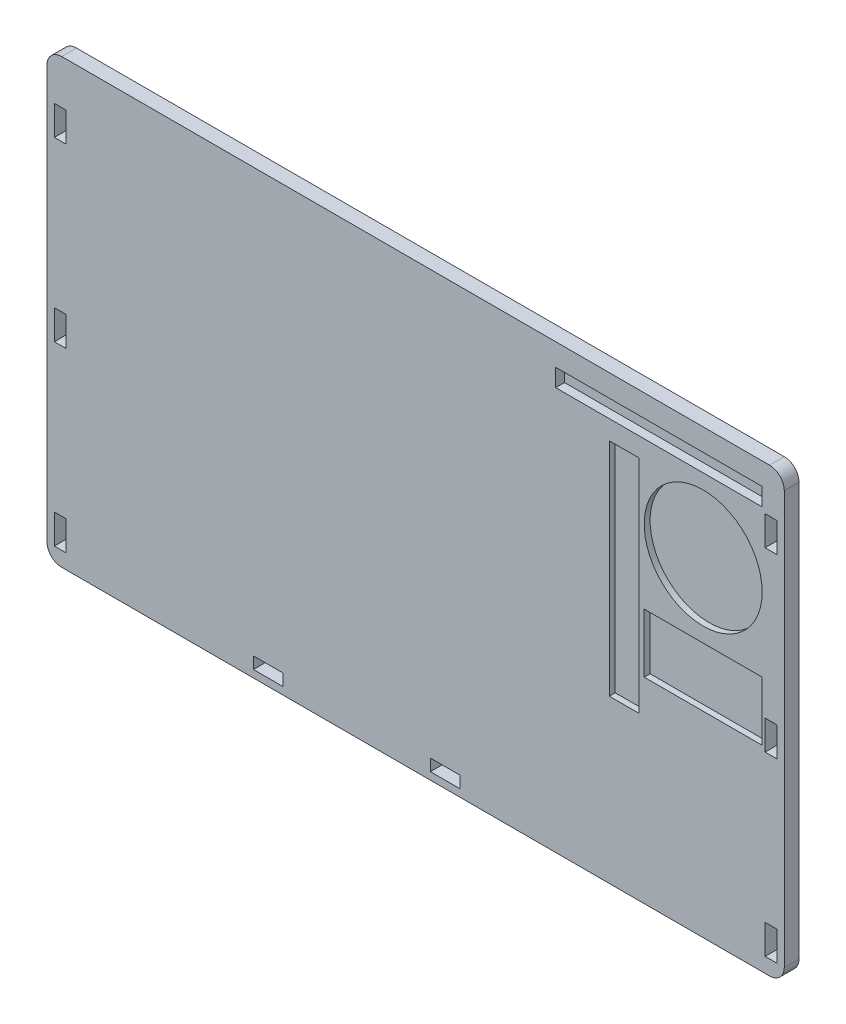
ISO-10303-21;
HEADER;
FILE_DESCRIPTION(('STEP AP214'),'2;1');
FILE_NAME('part.step','',(''),(''),'','','');
FILE_SCHEMA(('AUTOMOTIVE_DESIGN { 1 0 10303 214 1 1 1 1 }'));
ENDSEC;
DATA;
#1=APPLICATION_CONTEXT('core data for automotive mechanical design processes');
#2=APPLICATION_PROTOCOL_DEFINITION('international standard','automotive_design',2000,#1);
#3=PRODUCT_CONTEXT('',#1,'mechanical');
#4=PRODUCT('Part','Part','',(#3));
#5=PRODUCT_RELATED_PRODUCT_CATEGORY('part','',(#4));
#6=PRODUCT_DEFINITION_FORMATION('','',#4);
#7=PRODUCT_DEFINITION_CONTEXT('part definition',#1,'design');
#8=PRODUCT_DEFINITION('design','',#6,#7);
#9=PRODUCT_DEFINITION_SHAPE('','',#8);
#10=(LENGTH_UNIT() NAMED_UNIT(*) SI_UNIT(.MILLI.,.METRE.));
#11=(NAMED_UNIT(*) PLANE_ANGLE_UNIT() SI_UNIT($,.RADIAN.));
#12=(NAMED_UNIT(*) SI_UNIT($,.STERADIAN.) SOLID_ANGLE_UNIT());
#13=UNCERTAINTY_MEASURE_WITH_UNIT(LENGTH_MEASURE(1.E-05),#10,'distance_accuracy_value','');
#14=(GEOMETRIC_REPRESENTATION_CONTEXT(3) GLOBAL_UNCERTAINTY_ASSIGNED_CONTEXT((#13)) GLOBAL_UNIT_ASSIGNED_CONTEXT((#10,
#11,#12)) REPRESENTATION_CONTEXT('',''));
#15=CARTESIAN_POINT('',(0.,0.,0.));
#16=DIRECTION('',(0.,0.,1.));
#17=DIRECTION('',(1.,0.,0.));
#18=AXIS2_PLACEMENT_3D('',#15,#16,#17);
#19=CARTESIAN_POINT('',(-240.,140.,10.));
#20=DIRECTION('',(0.,0.,-1.));
#21=DIRECTION('',(-1.,0.,0.));
#22=AXIS2_PLACEMENT_3D('',#19,#20,#21);
#23=PLANE('',#22);
#24=DIRECTION('',(-1.,0.,0.));
#25=VECTOR('',#24,1.);
#26=CARTESIAN_POINT('',(131.33393019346,110.,10.));
#27=LINE('',#26,#25);
#28=CARTESIAN_POINT('',(151.33393019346,110.,10.));
#29=VERTEX_POINT('',#28);
#30=CARTESIAN_POINT('',(131.33393019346,110.,10.));
#31=VERTEX_POINT('',#30);
#32=EDGE_CURVE('E390',#29,#31,#27,.T.);
#33=ORIENTED_EDGE('',*,*,#32,.F.);
#34=DIRECTION('',(0.,1.,0.));
#35=VECTOR('',#34,1.);
#36=CARTESIAN_POINT('',(151.33393019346,110.,10.));
#37=LINE('',#36,#35);
#38=CARTESIAN_POINT('',(151.33393019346,-40.,10.));
#39=VERTEX_POINT('',#38);
#40=EDGE_CURVE('E47',#39,#29,#37,.T.);
#41=ORIENTED_EDGE('',*,*,#40,.F.);
#42=DIRECTION('',(1.,0.,0.));
#43=VECTOR('',#42,1.);
#44=CARTESIAN_POINT('',(131.33393019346,-40.,10.));
#45=LINE('',#44,#43);
#46=CARTESIAN_POINT('',(131.33393019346,-40.,10.));
#47=VERTEX_POINT('',#46);
#48=EDGE_CURVE('E381',#47,#39,#45,.T.);
#49=ORIENTED_EDGE('',*,*,#48,.F.);
#50=DIRECTION('',(0.,-1.,0.));
#51=VECTOR('',#50,1.);
#52=CARTESIAN_POINT('',(131.33393019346,110.,10.));
#53=LINE('',#52,#51);
#54=EDGE_CURVE('E384',#31,#47,#53,.T.);
#55=ORIENTED_EDGE('',*,*,#54,.F.);
#56=EDGE_LOOP('',(#33,#41,#49,#55));
#57=FACE_BOUND('',#56,.T.);
#58=CARTESIAN_POINT('',(195.,73.,10.));
#59=DIRECTION('',(0.,0.,1.));
#60=DIRECTION('',(1.,0.,0.));
#61=AXIS2_PLACEMENT_3D('',#58,#59,#60);
#62=CIRCLE('',#61,40.);
#63=CARTESIAN_POINT('',(235.,73.,10.));
#64=VERTEX_POINT('',#63);
#65=EDGE_CURVE('E396',#64,#64,#62,.T.);
#66=ORIENTED_EDGE('',*,*,#65,.F.);
#67=EDGE_LOOP('',(#66));
#68=FACE_BOUND('',#67,.T.);
#69=DIRECTION('',(-1.,0.,0.));
#70=VECTOR('',#69,1.);
#71=CARTESIAN_POINT('',(155.,23.,10.));
#72=LINE('',#71,#70);
#73=CARTESIAN_POINT('',(235.,23.,10.));
#74=VERTEX_POINT('',#73);
#75=CARTESIAN_POINT('',(155.,23.,10.));
#76=VERTEX_POINT('',#75);
#77=EDGE_CURVE('E420',#74,#76,#72,.T.);
#78=ORIENTED_EDGE('',*,*,#77,.F.);
#79=DIRECTION('',(0.,1.,0.));
#80=VECTOR('',#79,1.);
#81=CARTESIAN_POINT('',(235.,23.,10.));
#82=LINE('',#81,#80);
#83=CARTESIAN_POINT('',(235.,-17.,10.));
#84=VERTEX_POINT('',#83);
#85=EDGE_CURVE('E55',#84,#74,#82,.T.);
#86=ORIENTED_EDGE('',*,*,#85,.F.);
#87=DIRECTION('',(1.,0.,0.));
#88=VECTOR('',#87,1.);
#89=CARTESIAN_POINT('',(155.,-17.,10.));
#90=LINE('',#89,#88);
#91=CARTESIAN_POINT('',(155.,-17.,10.));
#92=VERTEX_POINT('',#91);
#93=EDGE_CURVE('E409',#92,#84,#90,.T.);
#94=ORIENTED_EDGE('',*,*,#93,.F.);
#95=DIRECTION('',(0.,-1.,0.));
#96=VECTOR('',#95,1.);
#97=CARTESIAN_POINT('',(155.,23.,10.));
#98=LINE('',#97,#96);
#99=EDGE_CURVE('E423',#76,#92,#98,.T.);
#100=ORIENTED_EDGE('',*,*,#99,.F.);
#101=EDGE_LOOP('',(#78,#86,#94,#100));
#102=FACE_BOUND('',#101,.T.);
#103=DIRECTION('',(0.,-1.,0.));
#104=VECTOR('',#103,1.);
#105=CARTESIAN_POINT('',(235.,135.,10.));
#106=LINE('',#105,#104);
#107=CARTESIAN_POINT('',(235.,135.,10.));
#108=VERTEX_POINT('',#107);
#109=CARTESIAN_POINT('',(235.,123.,10.));
#110=VERTEX_POINT('',#109);
#111=EDGE_CURVE('E449',#108,#110,#106,.T.);
#112=ORIENTED_EDGE('',*,*,#111,.T.);
#113=DIRECTION('',(1.,0.,0.));
#114=VECTOR('',#113,1.);
#115=CARTESIAN_POINT('',(94.9999999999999,123.,10.));
#116=LINE('',#115,#114);
#117=CARTESIAN_POINT('',(94.9999999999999,123.,10.));
#118=VERTEX_POINT('',#117);
#119=EDGE_CURVE('E430',#118,#110,#116,.T.);
#120=ORIENTED_EDGE('',*,*,#119,.F.);
#121=DIRECTION('',(0.,-1.,0.));
#122=VECTOR('',#121,1.);
#123=CARTESIAN_POINT('',(95.,135.,10.));
#124=LINE('',#123,#122);
#125=CARTESIAN_POINT('',(95.,135.,10.));
#126=VERTEX_POINT('',#125);
#127=EDGE_CURVE('E440',#126,#118,#124,.T.);
#128=ORIENTED_EDGE('',*,*,#127,.F.);
#129=DIRECTION('',(1.,0.,0.));
#130=VECTOR('',#129,1.);
#131=CARTESIAN_POINT('',(95.,135.,10.));
#132=LINE('',#131,#130);
#133=EDGE_CURVE('E452',#126,#108,#132,.T.);
#134=ORIENTED_EDGE('',*,*,#133,.T.);
#135=EDGE_LOOP('',(#112,#120,#128,#134));
#136=FACE_BOUND('',#135,.T.);
#137=DIRECTION('',(0.,-1.,0.));
#138=VECTOR('',#137,1.);
#139=CARTESIAN_POINT('',(-110.,-145.,10.));
#140=LINE('',#139,#138);
#141=CARTESIAN_POINT('',(-110.,-137.,10.));
#142=VERTEX_POINT('',#141);
#143=CARTESIAN_POINT('',(-110.,-145.,10.));
#144=VERTEX_POINT('',#143);
#145=EDGE_CURVE('E497',#142,#144,#140,.T.);
#146=ORIENTED_EDGE('',*,*,#145,.F.);
#147=DIRECTION('',(-1.,0.,0.));
#148=VECTOR('',#147,1.);
#149=CARTESIAN_POINT('',(-110.,-137.,10.));
#150=LINE('',#149,#148);
#151=CARTESIAN_POINT('',(-89.9999999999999,-137.,10.));
#152=VERTEX_POINT('',#151);
#153=EDGE_CURVE('E505',#152,#142,#150,.T.);
#154=ORIENTED_EDGE('',*,*,#153,.F.);
#155=DIRECTION('',(0.,1.,0.));
#156=VECTOR('',#155,1.);
#157=CARTESIAN_POINT('',(-89.9999999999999,-145.,10.));
#158=LINE('',#157,#156);
#159=CARTESIAN_POINT('',(-89.9999999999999,-145.,10.));
#160=VERTEX_POINT('',#159);
#161=EDGE_CURVE('E502',#160,#152,#158,.T.);
#162=ORIENTED_EDGE('',*,*,#161,.F.);
#163=DIRECTION('',(1.,0.,0.));
#164=VECTOR('',#163,1.);
#165=CARTESIAN_POINT('',(-110.,-145.,10.));
#166=LINE('',#165,#164);
#167=EDGE_CURVE('E499',#144,#160,#166,.T.);
#168=ORIENTED_EDGE('',*,*,#167,.F.);
#169=EDGE_LOOP('',(#146,#154,#162,#168));
#170=FACE_BOUND('',#169,.T.);
#171=DIRECTION('',(0.,1.,0.));
#172=VECTOR('',#171,1.);
#173=CARTESIAN_POINT('',(245.,0.,10.));
#174=LINE('',#173,#172);
#175=CARTESIAN_POINT('',(245.,-20.,10.));
#176=VERTEX_POINT('',#175);
#177=CARTESIAN_POINT('',(245.,0.,10.));
#178=VERTEX_POINT('',#177);
#179=EDGE_CURVE('E559',#176,#178,#174,.T.);
#180=ORIENTED_EDGE('',*,*,#179,.F.);
#181=DIRECTION('',(1.,0.,0.));
#182=VECTOR('',#181,1.);
#183=CARTESIAN_POINT('',(245.,-20.,10.));
#184=LINE('',#183,#182);
#185=CARTESIAN_POINT('',(237.,-20.0000000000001,10.));
#186=VERTEX_POINT('',#185);
#187=EDGE_CURVE('E567',#186,#176,#184,.T.);
#188=ORIENTED_EDGE('',*,*,#187,.F.);
#189=DIRECTION('',(0.,-1.,0.));
#190=VECTOR('',#189,1.);
#191=CARTESIAN_POINT('',(237.,0.,10.));
#192=LINE('',#191,#190);
#193=CARTESIAN_POINT('',(237.,0.,10.));
#194=VERTEX_POINT('',#193);
#195=EDGE_CURVE('E564',#194,#186,#192,.T.);
#196=ORIENTED_EDGE('',*,*,#195,.F.);
#197=DIRECTION('',(-1.,0.,0.));
#198=VECTOR('',#197,1.);
#199=CARTESIAN_POINT('',(245.,0.,10.));
#200=LINE('',#199,#198);
#201=EDGE_CURVE('E561',#178,#194,#200,.T.);
#202=ORIENTED_EDGE('',*,*,#201,.F.);
#203=EDGE_LOOP('',(#180,#188,#196,#202));
#204=FACE_BOUND('',#203,.T.);
#205=DIRECTION('',(0.,-1.,0.));
#206=VECTOR('',#205,1.);
#207=CARTESIAN_POINT('',(-245.,-120.,10.));
#208=LINE('',#207,#206);
#209=CARTESIAN_POINT('',(-245.,-120.,10.));
#210=VERTEX_POINT('',#209);
#211=CARTESIAN_POINT('',(-245.,-140.,10.));
#212=VERTEX_POINT('',#211);
#213=EDGE_CURVE('E621',#210,#212,#208,.T.);
#214=ORIENTED_EDGE('',*,*,#213,.F.);
#215=DIRECTION('',(-1.,0.,0.));
#216=VECTOR('',#215,1.);
#217=CARTESIAN_POINT('',(-245.,-120.,10.));
#218=LINE('',#217,#216);
#219=CARTESIAN_POINT('',(-237.,-120.,10.));
#220=VERTEX_POINT('',#219);
#221=EDGE_CURVE('E629',#220,#210,#218,.T.);
#222=ORIENTED_EDGE('',*,*,#221,.F.);
#223=DIRECTION('',(0.,1.,0.));
#224=VECTOR('',#223,1.);
#225=CARTESIAN_POINT('',(-237.,-120.,10.));
#226=LINE('',#225,#224);
#227=CARTESIAN_POINT('',(-237.,-140.,10.));
#228=VERTEX_POINT('',#227);
#229=EDGE_CURVE('E626',#228,#220,#226,.T.);
#230=ORIENTED_EDGE('',*,*,#229,.F.);
#231=DIRECTION('',(1.,0.,0.));
#232=VECTOR('',#231,1.);
#233=CARTESIAN_POINT('',(-245.,-140.,10.));
#234=LINE('',#233,#232);
#235=EDGE_CURVE('E623',#212,#228,#234,.T.);
#236=ORIENTED_EDGE('',*,*,#235,.F.);
#237=EDGE_LOOP('',(#214,#222,#230,#236));
#238=FACE_BOUND('',#237,.T.);
#239=DIRECTION('',(0.,1.,0.));
#240=VECTOR('',#239,1.);
#241=CARTESIAN_POINT('',(-237.,120.,10.));
#242=LINE('',#241,#240);
#243=CARTESIAN_POINT('',(-237.,100.,10.));
#244=VERTEX_POINT('',#243);
#245=CARTESIAN_POINT('',(-237.,120.,10.));
#246=VERTEX_POINT('',#245);
#247=EDGE_CURVE('E683',#244,#246,#242,.T.);
#248=ORIENTED_EDGE('',*,*,#247,.F.);
#249=DIRECTION('',(1.,0.,0.));
#250=VECTOR('',#249,1.);
#251=CARTESIAN_POINT('',(-245.,100.,10.));
#252=LINE('',#251,#250);
#253=CARTESIAN_POINT('',(-245.,100.,10.));
#254=VERTEX_POINT('',#253);
#255=EDGE_CURVE('E691',#254,#244,#252,.T.);
#256=ORIENTED_EDGE('',*,*,#255,.F.);
#257=DIRECTION('',(0.,-1.,0.));
#258=VECTOR('',#257,1.);
#259=CARTESIAN_POINT('',(-245.,120.,10.));
#260=LINE('',#259,#258);
#261=CARTESIAN_POINT('',(-245.,120.,10.));
#262=VERTEX_POINT('',#261);
#263=EDGE_CURVE('E688',#262,#254,#260,.T.);
#264=ORIENTED_EDGE('',*,*,#263,.F.);
#265=DIRECTION('',(-1.,0.,0.));
#266=VECTOR('',#265,1.);
#267=CARTESIAN_POINT('',(-245.,120.,10.));
#268=LINE('',#267,#266);
#269=EDGE_CURVE('E685',#246,#262,#268,.T.);
#270=ORIENTED_EDGE('',*,*,#269,.F.);
#271=EDGE_LOOP('',(#248,#256,#264,#270));
#272=FACE_BOUND('',#271,.T.);
#273=CARTESIAN_POINT('',(-240.,140.,10.));
#274=DIRECTION('',(0.,0.,1.));
#275=DIRECTION('',(-1.,0.,0.));
#276=AXIS2_PLACEMENT_3D('',#273,#274,#275);
#277=CIRCLE('',#276,10.);
#278=CARTESIAN_POINT('',(-240.,150.,10.));
#279=VERTEX_POINT('',#278);
#280=CARTESIAN_POINT('',(-250.,140.,10.));
#281=VERTEX_POINT('',#280);
#282=EDGE_CURVE('E714',#279,#281,#277,.T.);
#283=ORIENTED_EDGE('',*,*,#282,.T.);
#284=DIRECTION('',(0.,-1.,0.));
#285=VECTOR('',#284,1.);
#286=CARTESIAN_POINT('',(-250.,140.,10.));
#287=LINE('',#286,#285);
#288=CARTESIAN_POINT('',(-250.,-140.,10.));
#289=VERTEX_POINT('',#288);
#290=EDGE_CURVE('E717',#281,#289,#287,.T.);
#291=ORIENTED_EDGE('',*,*,#290,.T.);
#292=CARTESIAN_POINT('',(-240.,-140.,10.));
#293=DIRECTION('',(0.,0.,1.));
#294=DIRECTION('',(-1.,0.,0.));
#295=AXIS2_PLACEMENT_3D('',#292,#293,#294);
#296=CIRCLE('',#295,10.);
#297=CARTESIAN_POINT('',(-240.,-150.,10.));
#298=VERTEX_POINT('',#297);
#299=EDGE_CURVE('E720',#289,#298,#296,.T.);
#300=ORIENTED_EDGE('',*,*,#299,.T.);
#301=DIRECTION('',(1.,0.,0.));
#302=VECTOR('',#301,1.);
#303=CARTESIAN_POINT('',(-240.,-150.,10.));
#304=LINE('',#303,#302);
#305=CARTESIAN_POINT('',(240.,-150.,10.));
#306=VERTEX_POINT('',#305);
#307=EDGE_CURVE('E722',#298,#306,#304,.T.);
#308=ORIENTED_EDGE('',*,*,#307,.T.);
#309=CARTESIAN_POINT('',(240.,-140.,10.));
#310=DIRECTION('',(0.,0.,1.));
#311=DIRECTION('',(-1.,0.,0.));
#312=AXIS2_PLACEMENT_3D('',#309,#310,#311);
#313=CIRCLE('',#312,10.);
#314=CARTESIAN_POINT('',(250.,-140.,10.));
#315=VERTEX_POINT('',#314);
#316=EDGE_CURVE('E724',#306,#315,#313,.T.);
#317=ORIENTED_EDGE('',*,*,#316,.T.);
#318=DIRECTION('',(0.,1.,0.));
#319=VECTOR('',#318,1.);
#320=CARTESIAN_POINT('',(250.,140.,10.));
#321=LINE('',#320,#319);
#322=CARTESIAN_POINT('',(250.,140.,10.));
#323=VERTEX_POINT('',#322);
#324=EDGE_CURVE('E726',#315,#323,#321,.T.);
#325=ORIENTED_EDGE('',*,*,#324,.T.);
#326=CARTESIAN_POINT('',(240.,140.,10.));
#327=DIRECTION('',(0.,0.,1.));
#328=DIRECTION('',(1.,0.,0.));
#329=AXIS2_PLACEMENT_3D('',#326,#327,#328);
#330=CIRCLE('',#329,10.);
#331=CARTESIAN_POINT('',(240.,150.,10.));
#332=VERTEX_POINT('',#331);
#333=EDGE_CURVE('E728',#323,#332,#330,.T.);
#334=ORIENTED_EDGE('',*,*,#333,.T.);
#335=DIRECTION('',(-1.,0.,0.));
#336=VECTOR('',#335,1.);
#337=CARTESIAN_POINT('',(-240.,150.,10.));
#338=LINE('',#337,#336);
#339=EDGE_CURVE('E730',#332,#279,#338,.T.);
#340=ORIENTED_EDGE('',*,*,#339,.T.);
#341=EDGE_LOOP('',(#283,#291,#300,#308,#317,#325,#334,#340));
#342=FACE_BOUND('',#341,.T.);
#343=DIRECTION('',(0.,-1.,0.));
#344=VECTOR('',#343,1.);
#345=CARTESIAN_POINT('',(-245.,0.,10.));
#346=LINE('',#345,#344);
#347=CARTESIAN_POINT('',(-245.,0.,10.));
#348=VERTEX_POINT('',#347);
#349=CARTESIAN_POINT('',(-245.,-20.,10.));
#350=VERTEX_POINT('',#349);
#351=EDGE_CURVE('E652',#348,#350,#346,.T.);
#352=ORIENTED_EDGE('',*,*,#351,.F.);
#353=DIRECTION('',(-1.,0.,0.));
#354=VECTOR('',#353,1.);
#355=CARTESIAN_POINT('',(-245.,0.,10.));
#356=LINE('',#355,#354);
#357=CARTESIAN_POINT('',(-237.,0.,10.));
#358=VERTEX_POINT('',#357);
#359=EDGE_CURVE('E660',#358,#348,#356,.T.);
#360=ORIENTED_EDGE('',*,*,#359,.F.);
#361=DIRECTION('',(0.,1.,0.));
#362=VECTOR('',#361,1.);
#363=CARTESIAN_POINT('',(-237.,0.,10.));
#364=LINE('',#363,#362);
#365=CARTESIAN_POINT('',(-237.,-20.,10.));
#366=VERTEX_POINT('',#365);
#367=EDGE_CURVE('E657',#366,#358,#364,.T.);
#368=ORIENTED_EDGE('',*,*,#367,.F.);
#369=DIRECTION('',(1.,0.,0.));
#370=VECTOR('',#369,1.);
#371=CARTESIAN_POINT('',(-245.,-20.,10.));
#372=LINE('',#371,#370);
#373=EDGE_CURVE('E654',#350,#366,#372,.T.);
#374=ORIENTED_EDGE('',*,*,#373,.F.);
#375=EDGE_LOOP('',(#352,#360,#368,#374));
#376=FACE_BOUND('',#375,.T.);
#377=DIRECTION('',(0.,1.,0.));
#378=VECTOR('',#377,1.);
#379=CARTESIAN_POINT('',(245.,-120.,10.));
#380=LINE('',#379,#378);
#381=CARTESIAN_POINT('',(245.,-140.,10.));
#382=VERTEX_POINT('',#381);
#383=CARTESIAN_POINT('',(245.,-120.,10.));
#384=VERTEX_POINT('',#383);
#385=EDGE_CURVE('E590',#382,#384,#380,.T.);
#386=ORIENTED_EDGE('',*,*,#385,.F.);
#387=DIRECTION('',(1.,0.,0.));
#388=VECTOR('',#387,1.);
#389=CARTESIAN_POINT('',(245.,-140.,10.));
#390=LINE('',#389,#388);
#391=CARTESIAN_POINT('',(237.,-140.,10.));
#392=VERTEX_POINT('',#391);
#393=EDGE_CURVE('E598',#392,#382,#390,.T.);
#394=ORIENTED_EDGE('',*,*,#393,.F.);
#395=DIRECTION('',(0.,-1.,0.));
#396=VECTOR('',#395,1.);
#397=CARTESIAN_POINT('',(237.,-120.,10.));
#398=LINE('',#397,#396);
#399=CARTESIAN_POINT('',(237.,-120.,10.));
#400=VERTEX_POINT('',#399);
#401=EDGE_CURVE('E595',#400,#392,#398,.T.);
#402=ORIENTED_EDGE('',*,*,#401,.F.);
#403=DIRECTION('',(-1.,0.,0.));
#404=VECTOR('',#403,1.);
#405=CARTESIAN_POINT('',(245.,-120.,10.));
#406=LINE('',#405,#404);
#407=EDGE_CURVE('E592',#384,#400,#406,.T.);
#408=ORIENTED_EDGE('',*,*,#407,.F.);
#409=EDGE_LOOP('',(#386,#394,#402,#408));
#410=FACE_BOUND('',#409,.T.);
#411=DIRECTION('',(0.,1.,0.));
#412=VECTOR('',#411,1.);
#413=CARTESIAN_POINT('',(245.,120.,10.));
#414=LINE('',#413,#412);
#415=CARTESIAN_POINT('',(245.,99.9999999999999,10.));
#416=VERTEX_POINT('',#415);
#417=CARTESIAN_POINT('',(245.,120.,10.));
#418=VERTEX_POINT('',#417);
#419=EDGE_CURVE('E528',#416,#418,#414,.T.);
#420=ORIENTED_EDGE('',*,*,#419,.F.);
#421=DIRECTION('',(1.,0.,0.));
#422=VECTOR('',#421,1.);
#423=CARTESIAN_POINT('',(245.,99.9999999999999,10.));
#424=LINE('',#423,#422);
#425=CARTESIAN_POINT('',(237.,100.,10.));
#426=VERTEX_POINT('',#425);
#427=EDGE_CURVE('E536',#426,#416,#424,.T.);
#428=ORIENTED_EDGE('',*,*,#427,.F.);
#429=DIRECTION('',(0.,-1.,0.));
#430=VECTOR('',#429,1.);
#431=CARTESIAN_POINT('',(237.,120.,10.));
#432=LINE('',#431,#430);
#433=CARTESIAN_POINT('',(237.,120.,10.));
#434=VERTEX_POINT('',#433);
#435=EDGE_CURVE('E533',#434,#426,#432,.T.);
#436=ORIENTED_EDGE('',*,*,#435,.F.);
#437=DIRECTION('',(-1.,0.,0.));
#438=VECTOR('',#437,1.);
#439=CARTESIAN_POINT('',(245.,120.,10.));
#440=LINE('',#439,#438);
#441=EDGE_CURVE('E530',#418,#434,#440,.T.);
#442=ORIENTED_EDGE('',*,*,#441,.F.);
#443=EDGE_LOOP('',(#420,#428,#436,#442));
#444=FACE_BOUND('',#443,.T.);
#445=DIRECTION('',(0.,-1.,0.));
#446=VECTOR('',#445,1.);
#447=CARTESIAN_POINT('',(10.0000000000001,-145.,10.));
#448=LINE('',#447,#446);
#449=CARTESIAN_POINT('',(10.0000000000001,-137.,10.));
#450=VERTEX_POINT('',#449);
#451=CARTESIAN_POINT('',(10.0000000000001,-145.,10.));
#452=VERTEX_POINT('',#451);
#453=EDGE_CURVE('E466',#450,#452,#448,.T.);
#454=ORIENTED_EDGE('',*,*,#453,.F.);
#455=DIRECTION('',(-1.,0.,0.));
#456=VECTOR('',#455,1.);
#457=CARTESIAN_POINT('',(10.0000000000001,-137.,10.));
#458=LINE('',#457,#456);
#459=CARTESIAN_POINT('',(30.0000000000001,-137.,10.));
#460=VERTEX_POINT('',#459);
#461=EDGE_CURVE('E474',#460,#450,#458,.T.);
#462=ORIENTED_EDGE('',*,*,#461,.F.);
#463=DIRECTION('',(0.,1.,0.));
#464=VECTOR('',#463,1.);
#465=CARTESIAN_POINT('',(30.0000000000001,-145.,10.));
#466=LINE('',#465,#464);
#467=CARTESIAN_POINT('',(30.0000000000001,-145.,10.));
#468=VERTEX_POINT('',#467);
#469=EDGE_CURVE('E471',#468,#460,#466,.T.);
#470=ORIENTED_EDGE('',*,*,#469,.F.);
#471=DIRECTION('',(1.,0.,0.));
#472=VECTOR('',#471,1.);
#473=CARTESIAN_POINT('',(10.0000000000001,-145.,10.));
#474=LINE('',#473,#472);
#475=EDGE_CURVE('E468',#452,#468,#474,.T.);
#476=ORIENTED_EDGE('',*,*,#475,.F.);
#477=EDGE_LOOP('',(#454,#462,#470,#476));
#478=FACE_BOUND('',#477,.T.);
#479=ADVANCED_FACE('F32',(#57,#68,#102,#136,#170,#204,#238,#272,#342,#376,#410,#444,#478),#23,.F.);
#480=CARTESIAN_POINT('',(-240.,140.,0.));
#481=DIRECTION('',(0.,0.,-1.));
#482=DIRECTION('',(-1.,0.,0.));
#483=AXIS2_PLACEMENT_3D('',#480,#481,#482);
#484=PLANE('',#483);
#485=CARTESIAN_POINT('',(-240.,140.,0.));
#486=DIRECTION('',(0.,0.,1.));
#487=DIRECTION('',(-1.,0.,0.));
#488=AXIS2_PLACEMENT_3D('',#485,#486,#487);
#489=CIRCLE('',#488,10.);
#490=CARTESIAN_POINT('',(-240.,150.,0.));
#491=VERTEX_POINT('',#490);
#492=CARTESIAN_POINT('',(-250.,140.,0.));
#493=VERTEX_POINT('',#492);
#494=EDGE_CURVE('E713',#491,#493,#489,.T.);
#495=ORIENTED_EDGE('',*,*,#494,.F.);
#496=DIRECTION('',(-1.,0.,0.));
#497=VECTOR('',#496,1.);
#498=CARTESIAN_POINT('',(-240.,150.,0.));
#499=LINE('',#498,#497);
#500=CARTESIAN_POINT('',(240.,150.,0.));
#501=VERTEX_POINT('',#500);
#502=EDGE_CURVE('E718',#501,#491,#499,.T.);
#503=ORIENTED_EDGE('',*,*,#502,.F.);
#504=CARTESIAN_POINT('',(240.,140.,0.));
#505=DIRECTION('',(0.,0.,1.));
#506=DIRECTION('',(1.,0.,0.));
#507=AXIS2_PLACEMENT_3D('',#504,#505,#506);
#508=CIRCLE('',#507,10.);
#509=CARTESIAN_POINT('',(250.,140.,0.));
#510=VERTEX_POINT('',#509);
#511=EDGE_CURVE('E745',#510,#501,#508,.T.);
#512=ORIENTED_EDGE('',*,*,#511,.F.);
#513=DIRECTION('',(0.,1.,0.));
#514=VECTOR('',#513,1.);
#515=CARTESIAN_POINT('',(250.,140.,0.));
#516=LINE('',#515,#514);
#517=CARTESIAN_POINT('',(250.,-140.,0.));
#518=VERTEX_POINT('',#517);
#519=EDGE_CURVE('E743',#518,#510,#516,.T.);
#520=ORIENTED_EDGE('',*,*,#519,.F.);
#521=CARTESIAN_POINT('',(240.,-140.,0.));
#522=DIRECTION('',(0.,0.,1.));
#523=DIRECTION('',(-1.,0.,0.));
#524=AXIS2_PLACEMENT_3D('',#521,#522,#523);
#525=CIRCLE('',#524,10.);
#526=CARTESIAN_POINT('',(240.,-150.,0.));
#527=VERTEX_POINT('',#526);
#528=EDGE_CURVE('E741',#527,#518,#525,.T.);
#529=ORIENTED_EDGE('',*,*,#528,.F.);
#530=DIRECTION('',(1.,0.,0.));
#531=VECTOR('',#530,1.);
#532=CARTESIAN_POINT('',(-240.,-150.,0.));
#533=LINE('',#532,#531);
#534=CARTESIAN_POINT('',(-240.,-150.,0.));
#535=VERTEX_POINT('',#534);
#536=EDGE_CURVE('E739',#535,#527,#533,.T.);
#537=ORIENTED_EDGE('',*,*,#536,.F.);
#538=CARTESIAN_POINT('',(-240.,-140.,0.));
#539=DIRECTION('',(0.,0.,1.));
#540=DIRECTION('',(-1.,0.,0.));
#541=AXIS2_PLACEMENT_3D('',#538,#539,#540);
#542=CIRCLE('',#541,10.);
#543=CARTESIAN_POINT('',(-250.,-140.,0.));
#544=VERTEX_POINT('',#543);
#545=EDGE_CURVE('E737',#544,#535,#542,.T.);
#546=ORIENTED_EDGE('',*,*,#545,.F.);
#547=DIRECTION('',(0.,-1.,0.));
#548=VECTOR('',#547,1.);
#549=CARTESIAN_POINT('',(-250.,140.,0.));
#550=LINE('',#549,#548);
#551=EDGE_CURVE('E735',#493,#544,#550,.T.);
#552=ORIENTED_EDGE('',*,*,#551,.F.);
#553=EDGE_LOOP('',(#495,#503,#512,#520,#529,#537,#546,#552));
#554=FACE_BOUND('',#553,.T.);
#555=DIRECTION('',(1.,0.,0.));
#556=VECTOR('',#555,1.);
#557=CARTESIAN_POINT('',(-245.,100.,0.));
#558=LINE('',#557,#556);
#559=CARTESIAN_POINT('',(-245.,100.,0.));
#560=VERTEX_POINT('',#559);
#561=CARTESIAN_POINT('',(-237.,100.,0.));
#562=VERTEX_POINT('',#561);
#563=EDGE_CURVE('E686',#560,#562,#558,.T.);
#564=ORIENTED_EDGE('',*,*,#563,.T.);
#565=DIRECTION('',(0.,1.,0.));
#566=VECTOR('',#565,1.);
#567=CARTESIAN_POINT('',(-237.,120.,0.));
#568=LINE('',#567,#566);
#569=CARTESIAN_POINT('',(-237.,120.,0.));
#570=VERTEX_POINT('',#569);
#571=EDGE_CURVE('E682',#562,#570,#568,.T.);
#572=ORIENTED_EDGE('',*,*,#571,.T.);
#573=DIRECTION('',(-1.,0.,0.));
#574=VECTOR('',#573,1.);
#575=CARTESIAN_POINT('',(-245.,120.,0.));
#576=LINE('',#575,#574);
#577=CARTESIAN_POINT('',(-245.,120.,0.));
#578=VERTEX_POINT('',#577);
#579=EDGE_CURVE('E696',#570,#578,#576,.T.);
#580=ORIENTED_EDGE('',*,*,#579,.T.);
#581=DIRECTION('',(0.,-1.,0.));
#582=VECTOR('',#581,1.);
#583=CARTESIAN_POINT('',(-245.,120.,0.));
#584=LINE('',#583,#582);
#585=EDGE_CURVE('E699',#578,#560,#584,.T.);
#586=ORIENTED_EDGE('',*,*,#585,.T.);
#587=EDGE_LOOP('',(#564,#572,#580,#586));
#588=FACE_BOUND('',#587,.T.);
#589=DIRECTION('',(-1.,0.,0.));
#590=VECTOR('',#589,1.);
#591=CARTESIAN_POINT('',(-245.,0.,0.));
#592=LINE('',#591,#590);
#593=CARTESIAN_POINT('',(-237.,0.,0.));
#594=VERTEX_POINT('',#593);
#595=CARTESIAN_POINT('',(-245.,0.,0.));
#596=VERTEX_POINT('',#595);
#597=EDGE_CURVE('E655',#594,#596,#592,.T.);
#598=ORIENTED_EDGE('',*,*,#597,.T.);
#599=DIRECTION('',(0.,-1.,0.));
#600=VECTOR('',#599,1.);
#601=CARTESIAN_POINT('',(-245.,0.,0.));
#602=LINE('',#601,#600);
#603=CARTESIAN_POINT('',(-245.,-20.,0.));
#604=VERTEX_POINT('',#603);
#605=EDGE_CURVE('E651',#596,#604,#602,.T.);
#606=ORIENTED_EDGE('',*,*,#605,.T.);
#607=DIRECTION('',(1.,0.,0.));
#608=VECTOR('',#607,1.);
#609=CARTESIAN_POINT('',(-245.,-20.,0.));
#610=LINE('',#609,#608);
#611=CARTESIAN_POINT('',(-237.,-20.,0.));
#612=VERTEX_POINT('',#611);
#613=EDGE_CURVE('E665',#604,#612,#610,.T.);
#614=ORIENTED_EDGE('',*,*,#613,.T.);
#615=DIRECTION('',(0.,1.,0.));
#616=VECTOR('',#615,1.);
#617=CARTESIAN_POINT('',(-237.,0.,0.));
#618=LINE('',#617,#616);
#619=EDGE_CURVE('E668',#612,#594,#618,.T.);
#620=ORIENTED_EDGE('',*,*,#619,.T.);
#621=EDGE_LOOP('',(#598,#606,#614,#620));
#622=FACE_BOUND('',#621,.T.);
#623=DIRECTION('',(-1.,0.,0.));
#624=VECTOR('',#623,1.);
#625=CARTESIAN_POINT('',(-245.,-120.,0.));
#626=LINE('',#625,#624);
#627=CARTESIAN_POINT('',(-237.,-120.,0.));
#628=VERTEX_POINT('',#627);
#629=CARTESIAN_POINT('',(-245.,-120.,0.));
#630=VERTEX_POINT('',#629);
#631=EDGE_CURVE('E624',#628,#630,#626,.T.);
#632=ORIENTED_EDGE('',*,*,#631,.T.);
#633=DIRECTION('',(0.,-1.,0.));
#634=VECTOR('',#633,1.);
#635=CARTESIAN_POINT('',(-245.,-120.,0.));
#636=LINE('',#635,#634);
#637=CARTESIAN_POINT('',(-245.,-140.,0.));
#638=VERTEX_POINT('',#637);
#639=EDGE_CURVE('E620',#630,#638,#636,.T.);
#640=ORIENTED_EDGE('',*,*,#639,.T.);
#641=DIRECTION('',(1.,0.,0.));
#642=VECTOR('',#641,1.);
#643=CARTESIAN_POINT('',(-245.,-140.,0.));
#644=LINE('',#643,#642);
#645=CARTESIAN_POINT('',(-237.,-140.,0.));
#646=VERTEX_POINT('',#645);
#647=EDGE_CURVE('E634',#638,#646,#644,.T.);
#648=ORIENTED_EDGE('',*,*,#647,.T.);
#649=DIRECTION('',(0.,1.,0.));
#650=VECTOR('',#649,1.);
#651=CARTESIAN_POINT('',(-237.,-120.,0.));
#652=LINE('',#651,#650);
#653=EDGE_CURVE('E637',#646,#628,#652,.T.);
#654=ORIENTED_EDGE('',*,*,#653,.T.);
#655=EDGE_LOOP('',(#632,#640,#648,#654));
#656=FACE_BOUND('',#655,.T.);
#657=DIRECTION('',(1.,0.,0.));
#658=VECTOR('',#657,1.);
#659=CARTESIAN_POINT('',(245.,-140.,0.));
#660=LINE('',#659,#658);
#661=CARTESIAN_POINT('',(237.,-140.,0.));
#662=VERTEX_POINT('',#661);
#663=CARTESIAN_POINT('',(245.,-140.,0.));
#664=VERTEX_POINT('',#663);
#665=EDGE_CURVE('E593',#662,#664,#660,.T.);
#666=ORIENTED_EDGE('',*,*,#665,.T.);
#667=DIRECTION('',(0.,1.,0.));
#668=VECTOR('',#667,1.);
#669=CARTESIAN_POINT('',(245.,-120.,0.));
#670=LINE('',#669,#668);
#671=CARTESIAN_POINT('',(245.,-120.,0.));
#672=VERTEX_POINT('',#671);
#673=EDGE_CURVE('E589',#664,#672,#670,.T.);
#674=ORIENTED_EDGE('',*,*,#673,.T.);
#675=DIRECTION('',(-1.,0.,0.));
#676=VECTOR('',#675,1.);
#677=CARTESIAN_POINT('',(245.,-120.,0.));
#678=LINE('',#677,#676);
#679=CARTESIAN_POINT('',(237.,-120.,0.));
#680=VERTEX_POINT('',#679);
#681=EDGE_CURVE('E603',#672,#680,#678,.T.);
#682=ORIENTED_EDGE('',*,*,#681,.T.);
#683=DIRECTION('',(0.,-1.,0.));
#684=VECTOR('',#683,1.);
#685=CARTESIAN_POINT('',(237.,-120.,0.));
#686=LINE('',#685,#684);
#687=EDGE_CURVE('E606',#680,#662,#686,.T.);
#688=ORIENTED_EDGE('',*,*,#687,.T.);
#689=EDGE_LOOP('',(#666,#674,#682,#688));
#690=FACE_BOUND('',#689,.T.);
#691=DIRECTION('',(1.,0.,0.));
#692=VECTOR('',#691,1.);
#693=CARTESIAN_POINT('',(245.,-20.,0.));
#694=LINE('',#693,#692);
#695=CARTESIAN_POINT('',(237.,-20.,0.));
#696=VERTEX_POINT('',#695);
#697=CARTESIAN_POINT('',(245.,-20.0000000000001,0.));
#698=VERTEX_POINT('',#697);
#699=EDGE_CURVE('E562',#696,#698,#694,.T.);
#700=ORIENTED_EDGE('',*,*,#699,.T.);
#701=DIRECTION('',(0.,1.,0.));
#702=VECTOR('',#701,1.);
#703=CARTESIAN_POINT('',(245.,0.,0.));
#704=LINE('',#703,#702);
#705=CARTESIAN_POINT('',(245.,0.,0.));
#706=VERTEX_POINT('',#705);
#707=EDGE_CURVE('E558',#698,#706,#704,.T.);
#708=ORIENTED_EDGE('',*,*,#707,.T.);
#709=DIRECTION('',(-1.,0.,0.));
#710=VECTOR('',#709,1.);
#711=CARTESIAN_POINT('',(245.,0.,0.));
#712=LINE('',#711,#710);
#713=CARTESIAN_POINT('',(237.,0.,0.));
#714=VERTEX_POINT('',#713);
#715=EDGE_CURVE('E572',#706,#714,#712,.T.);
#716=ORIENTED_EDGE('',*,*,#715,.T.);
#717=DIRECTION('',(0.,-1.,0.));
#718=VECTOR('',#717,1.);
#719=CARTESIAN_POINT('',(237.,0.,0.));
#720=LINE('',#719,#718);
#721=EDGE_CURVE('E575',#714,#696,#720,.T.);
#722=ORIENTED_EDGE('',*,*,#721,.T.);
#723=EDGE_LOOP('',(#700,#708,#716,#722));
#724=FACE_BOUND('',#723,.T.);
#725=DIRECTION('',(1.,0.,0.));
#726=VECTOR('',#725,1.);
#727=CARTESIAN_POINT('',(245.,99.9999999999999,0.));
#728=LINE('',#727,#726);
#729=CARTESIAN_POINT('',(237.,100.,0.));
#730=VERTEX_POINT('',#729);
#731=CARTESIAN_POINT('',(245.,99.9999999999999,0.));
#732=VERTEX_POINT('',#731);
#733=EDGE_CURVE('E531',#730,#732,#728,.T.);
#734=ORIENTED_EDGE('',*,*,#733,.T.);
#735=DIRECTION('',(0.,1.,0.));
#736=VECTOR('',#735,1.);
#737=CARTESIAN_POINT('',(245.,120.,0.));
#738=LINE('',#737,#736);
#739=CARTESIAN_POINT('',(245.,120.,0.));
#740=VERTEX_POINT('',#739);
#741=EDGE_CURVE('E527',#732,#740,#738,.T.);
#742=ORIENTED_EDGE('',*,*,#741,.T.);
#743=DIRECTION('',(-1.,0.,0.));
#744=VECTOR('',#743,1.);
#745=CARTESIAN_POINT('',(245.,120.,0.));
#746=LINE('',#745,#744);
#747=CARTESIAN_POINT('',(237.,120.,0.));
#748=VERTEX_POINT('',#747);
#749=EDGE_CURVE('E541',#740,#748,#746,.T.);
#750=ORIENTED_EDGE('',*,*,#749,.T.);
#751=DIRECTION('',(0.,-1.,0.));
#752=VECTOR('',#751,1.);
#753=CARTESIAN_POINT('',(237.,120.,0.));
#754=LINE('',#753,#752);
#755=EDGE_CURVE('E544',#748,#730,#754,.T.);
#756=ORIENTED_EDGE('',*,*,#755,.T.);
#757=EDGE_LOOP('',(#734,#742,#750,#756));
#758=FACE_BOUND('',#757,.T.);
#759=DIRECTION('',(-1.,0.,0.));
#760=VECTOR('',#759,1.);
#761=CARTESIAN_POINT('',(-110.,-137.,0.));
#762=LINE('',#761,#760);
#763=CARTESIAN_POINT('',(-89.9999999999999,-137.,0.));
#764=VERTEX_POINT('',#763);
#765=CARTESIAN_POINT('',(-110.,-137.,0.));
#766=VERTEX_POINT('',#765);
#767=EDGE_CURVE('E500',#764,#766,#762,.T.);
#768=ORIENTED_EDGE('',*,*,#767,.T.);
#769=DIRECTION('',(0.,-1.,0.));
#770=VECTOR('',#769,1.);
#771=CARTESIAN_POINT('',(-110.,-145.,0.));
#772=LINE('',#771,#770);
#773=CARTESIAN_POINT('',(-110.,-145.,0.));
#774=VERTEX_POINT('',#773);
#775=EDGE_CURVE('E496',#766,#774,#772,.T.);
#776=ORIENTED_EDGE('',*,*,#775,.T.);
#777=DIRECTION('',(1.,0.,0.));
#778=VECTOR('',#777,1.);
#779=CARTESIAN_POINT('',(-110.,-145.,0.));
#780=LINE('',#779,#778);
#781=CARTESIAN_POINT('',(-89.9999999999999,-145.,0.));
#782=VERTEX_POINT('',#781);
#783=EDGE_CURVE('E510',#774,#782,#780,.T.);
#784=ORIENTED_EDGE('',*,*,#783,.T.);
#785=DIRECTION('',(0.,1.,0.));
#786=VECTOR('',#785,1.);
#787=CARTESIAN_POINT('',(-89.9999999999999,-145.,0.));
#788=LINE('',#787,#786);
#789=EDGE_CURVE('E513',#782,#764,#788,.T.);
#790=ORIENTED_EDGE('',*,*,#789,.T.);
#791=EDGE_LOOP('',(#768,#776,#784,#790));
#792=FACE_BOUND('',#791,.T.);
#793=DIRECTION('',(-1.,0.,0.));
#794=VECTOR('',#793,1.);
#795=CARTESIAN_POINT('',(10.0000000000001,-137.,0.));
#796=LINE('',#795,#794);
#797=CARTESIAN_POINT('',(30.0000000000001,-137.,0.));
#798=VERTEX_POINT('',#797);
#799=CARTESIAN_POINT('',(10.0000000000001,-137.,0.));
#800=VERTEX_POINT('',#799);
#801=EDGE_CURVE('E469',#798,#800,#796,.T.);
#802=ORIENTED_EDGE('',*,*,#801,.T.);
#803=DIRECTION('',(0.,-1.,0.));
#804=VECTOR('',#803,1.);
#805=CARTESIAN_POINT('',(10.0000000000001,-145.,0.));
#806=LINE('',#805,#804);
#807=CARTESIAN_POINT('',(10.0000000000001,-145.,0.));
#808=VERTEX_POINT('',#807);
#809=EDGE_CURVE('E459',#800,#808,#806,.T.);
#810=ORIENTED_EDGE('',*,*,#809,.T.);
#811=DIRECTION('',(1.,0.,0.));
#812=VECTOR('',#811,1.);
#813=CARTESIAN_POINT('',(10.0000000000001,-145.,0.));
#814=LINE('',#813,#812);
#815=CARTESIAN_POINT('',(30.0000000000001,-145.,0.));
#816=VERTEX_POINT('',#815);
#817=EDGE_CURVE('E479',#808,#816,#814,.T.);
#818=ORIENTED_EDGE('',*,*,#817,.T.);
#819=DIRECTION('',(0.,1.,0.));
#820=VECTOR('',#819,1.);
#821=CARTESIAN_POINT('',(30.0000000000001,-145.,0.));
#822=LINE('',#821,#820);
#823=EDGE_CURVE('E482',#816,#798,#822,.T.);
#824=ORIENTED_EDGE('',*,*,#823,.T.);
#825=EDGE_LOOP('',(#802,#810,#818,#824));
#826=FACE_BOUND('',#825,.T.);
#827=ADVANCED_FACE('F775',(#554,#588,#622,#656,#690,#724,#758,#792,#826),#484,.T.);
#828=CARTESIAN_POINT('',(-240.,140.,10.));
#829=DIRECTION('',(0.,0.,-1.));
#830=DIRECTION('',(-1.,0.,0.));
#831=AXIS2_PLACEMENT_3D('',#828,#829,#830);
#832=CYLINDRICAL_SURFACE('',#831,10.);
#833=ORIENTED_EDGE('',*,*,#494,.T.);
#834=DIRECTION('',(0.,0.,-1.));
#835=VECTOR('',#834,1.);
#836=CARTESIAN_POINT('',(-250.,140.,10.));
#837=LINE('',#836,#835);
#838=EDGE_CURVE('E11',#281,#493,#837,.T.);
#839=ORIENTED_EDGE('',*,*,#838,.F.);
#840=ORIENTED_EDGE('',*,*,#282,.F.);
#841=DIRECTION('',(0.,0.,-1.));
#842=VECTOR('',#841,1.);
#843=CARTESIAN_POINT('',(-240.,150.,10.));
#844=LINE('',#843,#842);
#845=EDGE_CURVE('E732',#279,#491,#844,.T.);
#846=ORIENTED_EDGE('',*,*,#845,.T.);
#847=EDGE_LOOP('',(#833,#839,#840,#846));
#848=FACE_BOUND('',#847,.T.);
#849=ADVANCED_FACE('F34',(#848),#832,.T.);
#850=CARTESIAN_POINT('',(-250.,140.,10.));
#851=DIRECTION('',(1.,0.,0.));
#852=DIRECTION('',(0.,0.,-1.));
#853=AXIS2_PLACEMENT_3D('',#850,#851,#852);
#854=PLANE('',#853);
#855=ORIENTED_EDGE('',*,*,#551,.T.);
#856=DIRECTION('',(0.,0.,-1.));
#857=VECTOR('',#856,1.);
#858=CARTESIAN_POINT('',(-250.,-140.,10.));
#859=LINE('',#858,#857);
#860=EDGE_CURVE('E40',#289,#544,#859,.T.);
#861=ORIENTED_EDGE('',*,*,#860,.F.);
#862=ORIENTED_EDGE('',*,*,#290,.F.);
#863=ORIENTED_EDGE('',*,*,#838,.T.);
#864=EDGE_LOOP('',(#855,#861,#862,#863));
#865=FACE_BOUND('',#864,.T.);
#866=ADVANCED_FACE('F793',(#865),#854,.F.);
#867=CARTESIAN_POINT('',(-240.,-140.,10.));
#868=DIRECTION('',(0.,0.,-1.));
#869=DIRECTION('',(-1.,0.,0.));
#870=AXIS2_PLACEMENT_3D('',#867,#868,#869);
#871=CYLINDRICAL_SURFACE('',#870,10.);
#872=ORIENTED_EDGE('',*,*,#545,.T.);
#873=DIRECTION('',(0.,0.,-1.));
#874=VECTOR('',#873,1.);
#875=CARTESIAN_POINT('',(-240.,-150.,10.));
#876=LINE('',#875,#874);
#877=EDGE_CURVE('E762',#298,#535,#876,.T.);
#878=ORIENTED_EDGE('',*,*,#877,.F.);
#879=ORIENTED_EDGE('',*,*,#299,.F.);
#880=ORIENTED_EDGE('',*,*,#860,.T.);
#881=EDGE_LOOP('',(#872,#878,#879,#880));
#882=FACE_BOUND('',#881,.T.);
#883=ADVANCED_FACE('F769',(#882),#871,.T.);
#884=CARTESIAN_POINT('',(-240.,-150.,10.));
#885=DIRECTION('',(0.,1.,0.));
#886=DIRECTION('',(0.,0.,1.));
#887=AXIS2_PLACEMENT_3D('',#884,#885,#886);
#888=PLANE('',#887);
#889=ORIENTED_EDGE('',*,*,#536,.T.);
#890=DIRECTION('',(0.,0.,-1.));
#891=VECTOR('',#890,1.);
#892=CARTESIAN_POINT('',(240.,-150.,10.));
#893=LINE('',#892,#891);
#894=EDGE_CURVE('E759',#306,#527,#893,.T.);
#895=ORIENTED_EDGE('',*,*,#894,.F.);
#896=ORIENTED_EDGE('',*,*,#307,.F.);
#897=ORIENTED_EDGE('',*,*,#877,.T.);
#898=EDGE_LOOP('',(#889,#895,#896,#897));
#899=FACE_BOUND('',#898,.T.);
#900=ADVANCED_FACE('F781',(#899),#888,.F.);
#901=CARTESIAN_POINT('',(240.,-140.,10.));
#902=DIRECTION('',(0.,0.,-1.));
#903=DIRECTION('',(-1.,0.,0.));
#904=AXIS2_PLACEMENT_3D('',#901,#902,#903);
#905=CYLINDRICAL_SURFACE('',#904,10.);
#906=ORIENTED_EDGE('',*,*,#528,.T.);
#907=DIRECTION('',(0.,0.,-1.));
#908=VECTOR('',#907,1.);
#909=CARTESIAN_POINT('',(250.,-140.,10.));
#910=LINE('',#909,#908);
#911=EDGE_CURVE('E756',#315,#518,#910,.T.);
#912=ORIENTED_EDGE('',*,*,#911,.F.);
#913=ORIENTED_EDGE('',*,*,#316,.F.);
#914=ORIENTED_EDGE('',*,*,#894,.T.);
#915=EDGE_LOOP('',(#906,#912,#913,#914));
#916=FACE_BOUND('',#915,.T.);
#917=ADVANCED_FACE('F785',(#916),#905,.T.);
#918=CARTESIAN_POINT('',(250.,140.,10.));
#919=DIRECTION('',(-1.,0.,0.));
#920=DIRECTION('',(0.,0.,1.));
#921=AXIS2_PLACEMENT_3D('',#918,#919,#920);
#922=PLANE('',#921);
#923=ORIENTED_EDGE('',*,*,#519,.T.);
#924=DIRECTION('',(0.,0.,-1.));
#925=VECTOR('',#924,1.);
#926=CARTESIAN_POINT('',(250.,140.,10.));
#927=LINE('',#926,#925);
#928=EDGE_CURVE('E753',#323,#510,#927,.T.);
#929=ORIENTED_EDGE('',*,*,#928,.F.);
#930=ORIENTED_EDGE('',*,*,#324,.F.);
#931=ORIENTED_EDGE('',*,*,#911,.T.);
#932=EDGE_LOOP('',(#923,#929,#930,#931));
#933=FACE_BOUND('',#932,.T.);
#934=ADVANCED_FACE('F806',(#933),#922,.F.);
#935=CARTESIAN_POINT('',(240.,140.,10.));
#936=DIRECTION('',(0.,0.,-1.));
#937=DIRECTION('',(-1.,0.,0.));
#938=AXIS2_PLACEMENT_3D('',#935,#936,#937);
#939=CYLINDRICAL_SURFACE('',#938,10.);
#940=ORIENTED_EDGE('',*,*,#511,.T.);
#941=DIRECTION('',(0.,0.,-1.));
#942=VECTOR('',#941,1.);
#943=CARTESIAN_POINT('',(240.,150.,10.));
#944=LINE('',#943,#942);
#945=EDGE_CURVE('E750',#332,#501,#944,.T.);
#946=ORIENTED_EDGE('',*,*,#945,.F.);
#947=ORIENTED_EDGE('',*,*,#333,.F.);
#948=ORIENTED_EDGE('',*,*,#928,.T.);
#949=EDGE_LOOP('',(#940,#946,#947,#948));
#950=FACE_BOUND('',#949,.T.);
#951=ADVANCED_FACE('F804',(#950),#939,.T.);
#952=CARTESIAN_POINT('',(-240.,150.,10.));
#953=DIRECTION('',(0.,-1.,0.));
#954=DIRECTION('',(0.,0.,-1.));
#955=AXIS2_PLACEMENT_3D('',#952,#953,#954);
#956=PLANE('',#955);
#957=ORIENTED_EDGE('',*,*,#502,.T.);
#958=ORIENTED_EDGE('',*,*,#845,.F.);
#959=ORIENTED_EDGE('',*,*,#339,.F.);
#960=ORIENTED_EDGE('',*,*,#945,.T.);
#961=EDGE_LOOP('',(#957,#958,#959,#960));
#962=FACE_BOUND('',#961,.T.);
#963=ADVANCED_FACE('F799',(#962),#956,.F.);
#964=CARTESIAN_POINT('',(-237.,120.,10.));
#965=DIRECTION('',(-1.,0.,0.));
#966=DIRECTION('',(0.,-1.,0.));
#967=AXIS2_PLACEMENT_3D('',#964,#965,#966);
#968=PLANE('',#967);
#969=ORIENTED_EDGE('',*,*,#571,.F.);
#970=DIRECTION('',(0.,0.,-1.));
#971=VECTOR('',#970,1.);
#972=CARTESIAN_POINT('',(-237.,100.,10.));
#973=LINE('',#972,#971);
#974=EDGE_CURVE('E693',#244,#562,#973,.T.);
#975=ORIENTED_EDGE('',*,*,#974,.F.);
#976=ORIENTED_EDGE('',*,*,#247,.T.);
#977=DIRECTION('',(0.,0.,-1.));
#978=VECTOR('',#977,1.);
#979=CARTESIAN_POINT('',(-237.,120.,10.));
#980=LINE('',#979,#978);
#981=EDGE_CURVE('E710',#246,#570,#980,.T.);
#982=ORIENTED_EDGE('',*,*,#981,.T.);
#983=EDGE_LOOP('',(#969,#975,#976,#982));
#984=FACE_BOUND('',#983,.T.);
#985=ADVANCED_FACE('F824',(#984),#968,.T.);
#986=CARTESIAN_POINT('',(-245.,120.,10.));
#987=DIRECTION('',(0.,-1.,0.));
#988=DIRECTION('',(1.,0.,0.));
#989=AXIS2_PLACEMENT_3D('',#986,#987,#988);
#990=PLANE('',#989);
#991=ORIENTED_EDGE('',*,*,#579,.F.);
#992=ORIENTED_EDGE('',*,*,#981,.F.);
#993=ORIENTED_EDGE('',*,*,#269,.T.);
#994=DIRECTION('',(0.,0.,-1.));
#995=VECTOR('',#994,1.);
#996=CARTESIAN_POINT('',(-245.,120.,10.));
#997=LINE('',#996,#995);
#998=EDGE_CURVE('E708',#262,#578,#997,.T.);
#999=ORIENTED_EDGE('',*,*,#998,.T.);
#1000=EDGE_LOOP('',(#991,#992,#993,#999));
#1001=FACE_BOUND('',#1000,.T.);
#1002=ADVANCED_FACE('F831',(#1001),#990,.T.);
#1003=CARTESIAN_POINT('',(-245.,120.,10.));
#1004=DIRECTION('',(1.,0.,0.));
#1005=DIRECTION('',(0.,1.,0.));
#1006=AXIS2_PLACEMENT_3D('',#1003,#1004,#1005);
#1007=PLANE('',#1006);
#1008=ORIENTED_EDGE('',*,*,#585,.F.);
#1009=ORIENTED_EDGE('',*,*,#998,.F.);
#1010=ORIENTED_EDGE('',*,*,#263,.T.);
#1011=DIRECTION('',(0.,0.,-1.));
#1012=VECTOR('',#1011,1.);
#1013=CARTESIAN_POINT('',(-245.,100.,10.));
#1014=LINE('',#1013,#1012);
#1015=EDGE_CURVE('E706',#254,#560,#1014,.T.);
#1016=ORIENTED_EDGE('',*,*,#1015,.T.);
#1017=EDGE_LOOP('',(#1008,#1009,#1010,#1016));
#1018=FACE_BOUND('',#1017,.T.);
#1019=ADVANCED_FACE('F836',(#1018),#1007,.T.);
#1020=CARTESIAN_POINT('',(-245.,100.,10.));
#1021=DIRECTION('',(0.,1.,0.));
#1022=DIRECTION('',(0.,0.,1.));
#1023=AXIS2_PLACEMENT_3D('',#1020,#1021,#1022);
#1024=PLANE('',#1023);
#1025=ORIENTED_EDGE('',*,*,#563,.F.);
#1026=ORIENTED_EDGE('',*,*,#1015,.F.);
#1027=ORIENTED_EDGE('',*,*,#255,.T.);
#1028=ORIENTED_EDGE('',*,*,#974,.T.);
#1029=EDGE_LOOP('',(#1025,#1026,#1027,#1028));
#1030=FACE_BOUND('',#1029,.T.);
#1031=ADVANCED_FACE('F843',(#1030),#1024,.T.);
#1032=CARTESIAN_POINT('',(-245.,0.,10.));
#1033=DIRECTION('',(1.,0.,0.));
#1034=DIRECTION('',(0.,0.,-1.));
#1035=AXIS2_PLACEMENT_3D('',#1032,#1033,#1034);
#1036=PLANE('',#1035);
#1037=ORIENTED_EDGE('',*,*,#605,.F.);
#1038=DIRECTION('',(0.,0.,-1.));
#1039=VECTOR('',#1038,1.);
#1040=CARTESIAN_POINT('',(-245.,0.,10.));
#1041=LINE('',#1040,#1039);
#1042=EDGE_CURVE('E662',#348,#596,#1041,.T.);
#1043=ORIENTED_EDGE('',*,*,#1042,.F.);
#1044=ORIENTED_EDGE('',*,*,#351,.T.);
#1045=DIRECTION('',(0.,0.,-1.));
#1046=VECTOR('',#1045,1.);
#1047=CARTESIAN_POINT('',(-245.,-20.,10.));
#1048=LINE('',#1047,#1046);
#1049=EDGE_CURVE('E679',#350,#604,#1048,.T.);
#1050=ORIENTED_EDGE('',*,*,#1049,.T.);
#1051=EDGE_LOOP('',(#1037,#1043,#1044,#1050));
#1052=FACE_BOUND('',#1051,.T.);
#1053=ADVANCED_FACE('F857',(#1052),#1036,.T.);
#1054=CARTESIAN_POINT('',(-245.,-20.,10.));
#1055=DIRECTION('',(0.,1.,0.));
#1056=DIRECTION('',(-1.,0.,0.));
#1057=AXIS2_PLACEMENT_3D('',#1054,#1055,#1056);
#1058=PLANE('',#1057);
#1059=ORIENTED_EDGE('',*,*,#613,.F.);
#1060=ORIENTED_EDGE('',*,*,#1049,.F.);
#1061=ORIENTED_EDGE('',*,*,#373,.T.);
#1062=DIRECTION('',(0.,0.,-1.));
#1063=VECTOR('',#1062,1.);
#1064=CARTESIAN_POINT('',(-237.,-20.,10.));
#1065=LINE('',#1064,#1063);
#1066=EDGE_CURVE('E677',#366,#612,#1065,.T.);
#1067=ORIENTED_EDGE('',*,*,#1066,.T.);
#1068=EDGE_LOOP('',(#1059,#1060,#1061,#1067));
#1069=FACE_BOUND('',#1068,.T.);
#1070=ADVANCED_FACE('F862',(#1069),#1058,.T.);
#1071=CARTESIAN_POINT('',(-237.,0.,10.));
#1072=DIRECTION('',(-1.,0.,0.));
#1073=DIRECTION('',(0.,0.,1.));
#1074=AXIS2_PLACEMENT_3D('',#1071,#1072,#1073);
#1075=PLANE('',#1074);
#1076=ORIENTED_EDGE('',*,*,#619,.F.);
#1077=ORIENTED_EDGE('',*,*,#1066,.F.);
#1078=ORIENTED_EDGE('',*,*,#367,.T.);
#1079=DIRECTION('',(0.,0.,-1.));
#1080=VECTOR('',#1079,1.);
#1081=CARTESIAN_POINT('',(-237.,0.,10.));
#1082=LINE('',#1081,#1080);
#1083=EDGE_CURVE('E675',#358,#594,#1082,.T.);
#1084=ORIENTED_EDGE('',*,*,#1083,.T.);
#1085=EDGE_LOOP('',(#1076,#1077,#1078,#1084));
#1086=FACE_BOUND('',#1085,.T.);
#1087=ADVANCED_FACE('F866',(#1086),#1075,.T.);
#1088=CARTESIAN_POINT('',(-245.,0.,10.));
#1089=DIRECTION('',(0.,-1.,0.));
#1090=DIRECTION('',(0.,0.,-1.));
#1091=AXIS2_PLACEMENT_3D('',#1088,#1089,#1090);
#1092=PLANE('',#1091);
#1093=ORIENTED_EDGE('',*,*,#597,.F.);
#1094=ORIENTED_EDGE('',*,*,#1083,.F.);
#1095=ORIENTED_EDGE('',*,*,#359,.T.);
#1096=ORIENTED_EDGE('',*,*,#1042,.T.);
#1097=EDGE_LOOP('',(#1093,#1094,#1095,#1096));
#1098=FACE_BOUND('',#1097,.T.);
#1099=ADVANCED_FACE('F870',(#1098),#1092,.T.);
#1100=CARTESIAN_POINT('',(-245.,-120.,10.));
#1101=DIRECTION('',(1.,0.,0.));
#1102=DIRECTION('',(0.,0.,-1.));
#1103=AXIS2_PLACEMENT_3D('',#1100,#1101,#1102);
#1104=PLANE('',#1103);
#1105=ORIENTED_EDGE('',*,*,#639,.F.);
#1106=DIRECTION('',(0.,0.,-1.));
#1107=VECTOR('',#1106,1.);
#1108=CARTESIAN_POINT('',(-245.,-120.,10.));
#1109=LINE('',#1108,#1107);
#1110=EDGE_CURVE('E631',#210,#630,#1109,.T.);
#1111=ORIENTED_EDGE('',*,*,#1110,.F.);
#1112=ORIENTED_EDGE('',*,*,#213,.T.);
#1113=DIRECTION('',(0.,0.,-1.));
#1114=VECTOR('',#1113,1.);
#1115=CARTESIAN_POINT('',(-245.,-140.,10.));
#1116=LINE('',#1115,#1114);
#1117=EDGE_CURVE('E648',#212,#638,#1116,.T.);
#1118=ORIENTED_EDGE('',*,*,#1117,.T.);
#1119=EDGE_LOOP('',(#1105,#1111,#1112,#1118));
#1120=FACE_BOUND('',#1119,.T.);
#1121=ADVANCED_FACE('F874',(#1120),#1104,.T.);
#1122=CARTESIAN_POINT('',(-245.,-140.,10.));
#1123=DIRECTION('',(0.,1.,0.));
#1124=DIRECTION('',(0.,0.,1.));
#1125=AXIS2_PLACEMENT_3D('',#1122,#1123,#1124);
#1126=PLANE('',#1125);
#1127=ORIENTED_EDGE('',*,*,#647,.F.);
#1128=ORIENTED_EDGE('',*,*,#1117,.F.);
#1129=ORIENTED_EDGE('',*,*,#235,.T.);
#1130=DIRECTION('',(0.,0.,-1.));
#1131=VECTOR('',#1130,1.);
#1132=CARTESIAN_POINT('',(-237.,-140.,10.));
#1133=LINE('',#1132,#1131);
#1134=EDGE_CURVE('E646',#228,#646,#1133,.T.);
#1135=ORIENTED_EDGE('',*,*,#1134,.T.);
#1136=EDGE_LOOP('',(#1127,#1128,#1129,#1135));
#1137=FACE_BOUND('',#1136,.T.);
#1138=ADVANCED_FACE('F878',(#1137),#1126,.T.);
#1139=CARTESIAN_POINT('',(-237.,-120.,10.));
#1140=DIRECTION('',(-1.,0.,0.));
#1141=DIRECTION('',(0.,0.,1.));
#1142=AXIS2_PLACEMENT_3D('',#1139,#1140,#1141);
#1143=PLANE('',#1142);
#1144=ORIENTED_EDGE('',*,*,#653,.F.);
#1145=ORIENTED_EDGE('',*,*,#1134,.F.);
#1146=ORIENTED_EDGE('',*,*,#229,.T.);
#1147=DIRECTION('',(0.,0.,-1.));
#1148=VECTOR('',#1147,1.);
#1149=CARTESIAN_POINT('',(-237.,-120.,10.));
#1150=LINE('',#1149,#1148);
#1151=EDGE_CURVE('E644',#220,#628,#1150,.T.);
#1152=ORIENTED_EDGE('',*,*,#1151,.T.);
#1153=EDGE_LOOP('',(#1144,#1145,#1146,#1152));
#1154=FACE_BOUND('',#1153,.T.);
#1155=ADVANCED_FACE('F882',(#1154),#1143,.T.);
#1156=CARTESIAN_POINT('',(-245.,-120.,10.));
#1157=DIRECTION('',(0.,-1.,0.));
#1158=DIRECTION('',(0.,0.,-1.));
#1159=AXIS2_PLACEMENT_3D('',#1156,#1157,#1158);
#1160=PLANE('',#1159);
#1161=ORIENTED_EDGE('',*,*,#631,.F.);
#1162=ORIENTED_EDGE('',*,*,#1151,.F.);
#1163=ORIENTED_EDGE('',*,*,#221,.T.);
#1164=ORIENTED_EDGE('',*,*,#1110,.T.);
#1165=EDGE_LOOP('',(#1161,#1162,#1163,#1164));
#1166=FACE_BOUND('',#1165,.T.);
#1167=ADVANCED_FACE('F886',(#1166),#1160,.T.);
#1168=CARTESIAN_POINT('',(245.,-120.,10.));
#1169=DIRECTION('',(-1.,0.,0.));
#1170=DIRECTION('',(0.,0.,1.));
#1171=AXIS2_PLACEMENT_3D('',#1168,#1169,#1170);
#1172=PLANE('',#1171);
#1173=ORIENTED_EDGE('',*,*,#673,.F.);
#1174=DIRECTION('',(0.,0.,-1.));
#1175=VECTOR('',#1174,1.);
#1176=CARTESIAN_POINT('',(245.,-140.,10.));
#1177=LINE('',#1176,#1175);
#1178=EDGE_CURVE('E600',#382,#664,#1177,.T.);
#1179=ORIENTED_EDGE('',*,*,#1178,.F.);
#1180=ORIENTED_EDGE('',*,*,#385,.T.);
#1181=DIRECTION('',(0.,0.,-1.));
#1182=VECTOR('',#1181,1.);
#1183=CARTESIAN_POINT('',(245.,-120.,10.));
#1184=LINE('',#1183,#1182);
#1185=EDGE_CURVE('E617',#384,#672,#1184,.T.);
#1186=ORIENTED_EDGE('',*,*,#1185,.T.);
#1187=EDGE_LOOP('',(#1173,#1179,#1180,#1186));
#1188=FACE_BOUND('',#1187,.T.);
#1189=ADVANCED_FACE('F890',(#1188),#1172,.T.);
#1190=CARTESIAN_POINT('',(245.,-120.,10.));
#1191=DIRECTION('',(0.,-1.,0.));
#1192=DIRECTION('',(0.,0.,-1.));
#1193=AXIS2_PLACEMENT_3D('',#1190,#1191,#1192);
#1194=PLANE('',#1193);
#1195=ORIENTED_EDGE('',*,*,#681,.F.);
#1196=ORIENTED_EDGE('',*,*,#1185,.F.);
#1197=ORIENTED_EDGE('',*,*,#407,.T.);
#1198=DIRECTION('',(0.,0.,-1.));
#1199=VECTOR('',#1198,1.);
#1200=CARTESIAN_POINT('',(237.,-120.,10.));
#1201=LINE('',#1200,#1199);
#1202=EDGE_CURVE('E615',#400,#680,#1201,.T.);
#1203=ORIENTED_EDGE('',*,*,#1202,.T.);
#1204=EDGE_LOOP('',(#1195,#1196,#1197,#1203));
#1205=FACE_BOUND('',#1204,.T.);
#1206=ADVANCED_FACE('F894',(#1205),#1194,.T.);
#1207=CARTESIAN_POINT('',(237.,-120.,10.));
#1208=DIRECTION('',(1.,0.,0.));
#1209=DIRECTION('',(0.,0.,-1.));
#1210=AXIS2_PLACEMENT_3D('',#1207,#1208,#1209);
#1211=PLANE('',#1210);
#1212=ORIENTED_EDGE('',*,*,#687,.F.);
#1213=ORIENTED_EDGE('',*,*,#1202,.F.);
#1214=ORIENTED_EDGE('',*,*,#401,.T.);
#1215=DIRECTION('',(0.,0.,-1.));
#1216=VECTOR('',#1215,1.);
#1217=CARTESIAN_POINT('',(237.,-140.,10.));
#1218=LINE('',#1217,#1216);
#1219=EDGE_CURVE('E613',#392,#662,#1218,.T.);
#1220=ORIENTED_EDGE('',*,*,#1219,.T.);
#1221=EDGE_LOOP('',(#1212,#1213,#1214,#1220));
#1222=FACE_BOUND('',#1221,.T.);
#1223=ADVANCED_FACE('F898',(#1222),#1211,.T.);
#1224=CARTESIAN_POINT('',(245.,-140.,10.));
#1225=DIRECTION('',(0.,1.,0.));
#1226=DIRECTION('',(0.,0.,1.));
#1227=AXIS2_PLACEMENT_3D('',#1224,#1225,#1226);
#1228=PLANE('',#1227);
#1229=ORIENTED_EDGE('',*,*,#665,.F.);
#1230=ORIENTED_EDGE('',*,*,#1219,.F.);
#1231=ORIENTED_EDGE('',*,*,#393,.T.);
#1232=ORIENTED_EDGE('',*,*,#1178,.T.);
#1233=EDGE_LOOP('',(#1229,#1230,#1231,#1232));
#1234=FACE_BOUND('',#1233,.T.);
#1235=ADVANCED_FACE('F902',(#1234),#1228,.T.);
#1236=CARTESIAN_POINT('',(245.,0.,10.));
#1237=DIRECTION('',(-1.,0.,0.));
#1238=DIRECTION('',(0.,0.,1.));
#1239=AXIS2_PLACEMENT_3D('',#1236,#1237,#1238);
#1240=PLANE('',#1239);
#1241=ORIENTED_EDGE('',*,*,#707,.F.);
#1242=DIRECTION('',(0.,0.,-1.));
#1243=VECTOR('',#1242,1.);
#1244=CARTESIAN_POINT('',(245.,-20.,10.));
#1245=LINE('',#1244,#1243);
#1246=EDGE_CURVE('E569',#176,#698,#1245,.T.);
#1247=ORIENTED_EDGE('',*,*,#1246,.F.);
#1248=ORIENTED_EDGE('',*,*,#179,.T.);
#1249=DIRECTION('',(0.,0.,-1.));
#1250=VECTOR('',#1249,1.);
#1251=CARTESIAN_POINT('',(245.,0.,10.));
#1252=LINE('',#1251,#1250);
#1253=EDGE_CURVE('E586',#178,#706,#1252,.T.);
#1254=ORIENTED_EDGE('',*,*,#1253,.T.);
#1255=EDGE_LOOP('',(#1241,#1247,#1248,#1254));
#1256=FACE_BOUND('',#1255,.T.);
#1257=ADVANCED_FACE('F906',(#1256),#1240,.T.);
#1258=CARTESIAN_POINT('',(245.,0.,10.));
#1259=DIRECTION('',(0.,-1.,0.));
#1260=DIRECTION('',(0.,0.,-1.));
#1261=AXIS2_PLACEMENT_3D('',#1258,#1259,#1260);
#1262=PLANE('',#1261);
#1263=ORIENTED_EDGE('',*,*,#715,.F.);
#1264=ORIENTED_EDGE('',*,*,#1253,.F.);
#1265=ORIENTED_EDGE('',*,*,#201,.T.);
#1266=DIRECTION('',(0.,0.,-1.));
#1267=VECTOR('',#1266,1.);
#1268=CARTESIAN_POINT('',(237.,0.,10.));
#1269=LINE('',#1268,#1267);
#1270=EDGE_CURVE('E584',#194,#714,#1269,.T.);
#1271=ORIENTED_EDGE('',*,*,#1270,.T.);
#1272=EDGE_LOOP('',(#1263,#1264,#1265,#1271));
#1273=FACE_BOUND('',#1272,.T.);
#1274=ADVANCED_FACE('F910',(#1273),#1262,.T.);
#1275=CARTESIAN_POINT('',(237.,0.,10.));
#1276=DIRECTION('',(1.,0.,0.));
#1277=DIRECTION('',(0.,0.,-1.));
#1278=AXIS2_PLACEMENT_3D('',#1275,#1276,#1277);
#1279=PLANE('',#1278);
#1280=ORIENTED_EDGE('',*,*,#721,.F.);
#1281=ORIENTED_EDGE('',*,*,#1270,.F.);
#1282=ORIENTED_EDGE('',*,*,#195,.T.);
#1283=DIRECTION('',(0.,0.,-1.));
#1284=VECTOR('',#1283,1.);
#1285=CARTESIAN_POINT('',(237.,-20.,10.));
#1286=LINE('',#1285,#1284);
#1287=EDGE_CURVE('E582',#186,#696,#1286,.T.);
#1288=ORIENTED_EDGE('',*,*,#1287,.T.);
#1289=EDGE_LOOP('',(#1280,#1281,#1282,#1288));
#1290=FACE_BOUND('',#1289,.T.);
#1291=ADVANCED_FACE('F914',(#1290),#1279,.T.);
#1292=CARTESIAN_POINT('',(245.,-20.,10.));
#1293=DIRECTION('',(0.,1.,0.));
#1294=DIRECTION('',(-1.,0.,0.));
#1295=AXIS2_PLACEMENT_3D('',#1292,#1293,#1294);
#1296=PLANE('',#1295);
#1297=ORIENTED_EDGE('',*,*,#699,.F.);
#1298=ORIENTED_EDGE('',*,*,#1287,.F.);
#1299=ORIENTED_EDGE('',*,*,#187,.T.);
#1300=ORIENTED_EDGE('',*,*,#1246,.T.);
#1301=EDGE_LOOP('',(#1297,#1298,#1299,#1300));
#1302=FACE_BOUND('',#1301,.T.);
#1303=ADVANCED_FACE('F918',(#1302),#1296,.T.);
#1304=CARTESIAN_POINT('',(245.,120.,10.));
#1305=DIRECTION('',(-1.,0.,0.));
#1306=DIRECTION('',(0.,0.,1.));
#1307=AXIS2_PLACEMENT_3D('',#1304,#1305,#1306);
#1308=PLANE('',#1307);
#1309=ORIENTED_EDGE('',*,*,#741,.F.);
#1310=DIRECTION('',(0.,0.,-1.));
#1311=VECTOR('',#1310,1.);
#1312=CARTESIAN_POINT('',(245.,99.9999999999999,10.));
#1313=LINE('',#1312,#1311);
#1314=EDGE_CURVE('E538',#416,#732,#1313,.T.);
#1315=ORIENTED_EDGE('',*,*,#1314,.F.);
#1316=ORIENTED_EDGE('',*,*,#419,.T.);
#1317=DIRECTION('',(0.,0.,-1.));
#1318=VECTOR('',#1317,1.);
#1319=CARTESIAN_POINT('',(245.,120.,10.));
#1320=LINE('',#1319,#1318);
#1321=EDGE_CURVE('E555',#418,#740,#1320,.T.);
#1322=ORIENTED_EDGE('',*,*,#1321,.T.);
#1323=EDGE_LOOP('',(#1309,#1315,#1316,#1322));
#1324=FACE_BOUND('',#1323,.T.);
#1325=ADVANCED_FACE('F922',(#1324),#1308,.T.);
#1326=CARTESIAN_POINT('',(245.,120.,10.));
#1327=DIRECTION('',(0.,-1.,0.));
#1328=DIRECTION('',(1.,0.,0.));
#1329=AXIS2_PLACEMENT_3D('',#1326,#1327,#1328);
#1330=PLANE('',#1329);
#1331=ORIENTED_EDGE('',*,*,#749,.F.);
#1332=ORIENTED_EDGE('',*,*,#1321,.F.);
#1333=ORIENTED_EDGE('',*,*,#441,.T.);
#1334=DIRECTION('',(0.,0.,-1.));
#1335=VECTOR('',#1334,1.);
#1336=CARTESIAN_POINT('',(237.,120.,10.));
#1337=LINE('',#1336,#1335);
#1338=EDGE_CURVE('E553',#434,#748,#1337,.T.);
#1339=ORIENTED_EDGE('',*,*,#1338,.T.);
#1340=EDGE_LOOP('',(#1331,#1332,#1333,#1339));
#1341=FACE_BOUND('',#1340,.T.);
#1342=ADVANCED_FACE('F926',(#1341),#1330,.T.);
#1343=CARTESIAN_POINT('',(237.,120.,10.));
#1344=DIRECTION('',(1.,0.,0.));
#1345=DIRECTION('',(0.,1.,0.));
#1346=AXIS2_PLACEMENT_3D('',#1343,#1344,#1345);
#1347=PLANE('',#1346);
#1348=ORIENTED_EDGE('',*,*,#755,.F.);
#1349=ORIENTED_EDGE('',*,*,#1338,.F.);
#1350=ORIENTED_EDGE('',*,*,#435,.T.);
#1351=DIRECTION('',(0.,0.,-1.));
#1352=VECTOR('',#1351,1.);
#1353=CARTESIAN_POINT('',(237.,100.,10.));
#1354=LINE('',#1353,#1352);
#1355=EDGE_CURVE('E551',#426,#730,#1354,.T.);
#1356=ORIENTED_EDGE('',*,*,#1355,.T.);
#1357=EDGE_LOOP('',(#1348,#1349,#1350,#1356));
#1358=FACE_BOUND('',#1357,.T.);
#1359=ADVANCED_FACE('F930',(#1358),#1347,.T.);
#1360=CARTESIAN_POINT('',(245.,99.9999999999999,10.));
#1361=DIRECTION('',(0.,1.,0.));
#1362=DIRECTION('',(-1.,0.,0.));
#1363=AXIS2_PLACEMENT_3D('',#1360,#1361,#1362);
#1364=PLANE('',#1363);
#1365=ORIENTED_EDGE('',*,*,#733,.F.);
#1366=ORIENTED_EDGE('',*,*,#1355,.F.);
#1367=ORIENTED_EDGE('',*,*,#427,.T.);
#1368=ORIENTED_EDGE('',*,*,#1314,.T.);
#1369=EDGE_LOOP('',(#1365,#1366,#1367,#1368));
#1370=FACE_BOUND('',#1369,.T.);
#1371=ADVANCED_FACE('F934',(#1370),#1364,.T.);
#1372=CARTESIAN_POINT('',(-110.,-145.,10.));
#1373=DIRECTION('',(1.,0.,0.));
#1374=DIRECTION('',(0.,0.,-1.));
#1375=AXIS2_PLACEMENT_3D('',#1372,#1373,#1374);
#1376=PLANE('',#1375);
#1377=ORIENTED_EDGE('',*,*,#775,.F.);
#1378=DIRECTION('',(0.,0.,-1.));
#1379=VECTOR('',#1378,1.);
#1380=CARTESIAN_POINT('',(-110.,-137.,10.));
#1381=LINE('',#1380,#1379);
#1382=EDGE_CURVE('E507',#142,#766,#1381,.T.);
#1383=ORIENTED_EDGE('',*,*,#1382,.F.);
#1384=ORIENTED_EDGE('',*,*,#145,.T.);
#1385=DIRECTION('',(0.,0.,-1.));
#1386=VECTOR('',#1385,1.);
#1387=CARTESIAN_POINT('',(-110.,-145.,10.));
#1388=LINE('',#1387,#1386);
#1389=EDGE_CURVE('E524',#144,#774,#1388,.T.);
#1390=ORIENTED_EDGE('',*,*,#1389,.T.);
#1391=EDGE_LOOP('',(#1377,#1383,#1384,#1390));
#1392=FACE_BOUND('',#1391,.T.);
#1393=ADVANCED_FACE('F938',(#1392),#1376,.T.);
#1394=CARTESIAN_POINT('',(-110.,-145.,10.));
#1395=DIRECTION('',(0.,1.,0.));
#1396=DIRECTION('',(0.,0.,1.));
#1397=AXIS2_PLACEMENT_3D('',#1394,#1395,#1396);
#1398=PLANE('',#1397);
#1399=ORIENTED_EDGE('',*,*,#783,.F.);
#1400=ORIENTED_EDGE('',*,*,#1389,.F.);
#1401=ORIENTED_EDGE('',*,*,#167,.T.);
#1402=DIRECTION('',(0.,0.,-1.));
#1403=VECTOR('',#1402,1.);
#1404=CARTESIAN_POINT('',(-89.9999999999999,-145.,10.));
#1405=LINE('',#1404,#1403);
#1406=EDGE_CURVE('E522',#160,#782,#1405,.T.);
#1407=ORIENTED_EDGE('',*,*,#1406,.T.);
#1408=EDGE_LOOP('',(#1399,#1400,#1401,#1407));
#1409=FACE_BOUND('',#1408,.T.);
#1410=ADVANCED_FACE('F942',(#1409),#1398,.T.);
#1411=CARTESIAN_POINT('',(-89.9999999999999,-145.,10.));
#1412=DIRECTION('',(-1.,0.,0.));
#1413=DIRECTION('',(0.,0.,1.));
#1414=AXIS2_PLACEMENT_3D('',#1411,#1412,#1413);
#1415=PLANE('',#1414);
#1416=ORIENTED_EDGE('',*,*,#789,.F.);
#1417=ORIENTED_EDGE('',*,*,#1406,.F.);
#1418=ORIENTED_EDGE('',*,*,#161,.T.);
#1419=DIRECTION('',(0.,0.,-1.));
#1420=VECTOR('',#1419,1.);
#1421=CARTESIAN_POINT('',(-89.9999999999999,-137.,10.));
#1422=LINE('',#1421,#1420);
#1423=EDGE_CURVE('E520',#152,#764,#1422,.T.);
#1424=ORIENTED_EDGE('',*,*,#1423,.T.);
#1425=EDGE_LOOP('',(#1416,#1417,#1418,#1424));
#1426=FACE_BOUND('',#1425,.T.);
#1427=ADVANCED_FACE('F946',(#1426),#1415,.T.);
#1428=CARTESIAN_POINT('',(-110.,-137.,10.));
#1429=DIRECTION('',(0.,-1.,0.));
#1430=DIRECTION('',(0.,0.,-1.));
#1431=AXIS2_PLACEMENT_3D('',#1428,#1429,#1430);
#1432=PLANE('',#1431);
#1433=ORIENTED_EDGE('',*,*,#767,.F.);
#1434=ORIENTED_EDGE('',*,*,#1423,.F.);
#1435=ORIENTED_EDGE('',*,*,#153,.T.);
#1436=ORIENTED_EDGE('',*,*,#1382,.T.);
#1437=EDGE_LOOP('',(#1433,#1434,#1435,#1436));
#1438=FACE_BOUND('',#1437,.T.);
#1439=ADVANCED_FACE('F950',(#1438),#1432,.T.);
#1440=CARTESIAN_POINT('',(10.0000000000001,-145.,10.));
#1441=DIRECTION('',(1.,0.,0.));
#1442=DIRECTION('',(0.,0.,-1.));
#1443=AXIS2_PLACEMENT_3D('',#1440,#1441,#1442);
#1444=PLANE('',#1443);
#1445=ORIENTED_EDGE('',*,*,#809,.F.);
#1446=DIRECTION('',(0.,0.,-1.));
#1447=VECTOR('',#1446,1.);
#1448=CARTESIAN_POINT('',(10.0000000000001,-137.,10.));
#1449=LINE('',#1448,#1447);
#1450=EDGE_CURVE('E476',#450,#800,#1449,.T.);
#1451=ORIENTED_EDGE('',*,*,#1450,.F.);
#1452=ORIENTED_EDGE('',*,*,#453,.T.);
#1453=DIRECTION('',(0.,0.,-1.));
#1454=VECTOR('',#1453,1.);
#1455=CARTESIAN_POINT('',(10.0000000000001,-145.,10.));
#1456=LINE('',#1455,#1454);
#1457=EDGE_CURVE('E493',#452,#808,#1456,.T.);
#1458=ORIENTED_EDGE('',*,*,#1457,.T.);
#1459=EDGE_LOOP('',(#1445,#1451,#1452,#1458));
#1460=FACE_BOUND('',#1459,.T.);
#1461=ADVANCED_FACE('F954',(#1460),#1444,.T.);
#1462=CARTESIAN_POINT('',(10.0000000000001,-145.,10.));
#1463=DIRECTION('',(0.,1.,0.));
#1464=DIRECTION('',(0.,0.,1.));
#1465=AXIS2_PLACEMENT_3D('',#1462,#1463,#1464);
#1466=PLANE('',#1465);
#1467=ORIENTED_EDGE('',*,*,#817,.F.);
#1468=ORIENTED_EDGE('',*,*,#1457,.F.);
#1469=ORIENTED_EDGE('',*,*,#475,.T.);
#1470=DIRECTION('',(0.,0.,-1.));
#1471=VECTOR('',#1470,1.);
#1472=CARTESIAN_POINT('',(30.0000000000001,-145.,10.));
#1473=LINE('',#1472,#1471);
#1474=EDGE_CURVE('E491',#468,#816,#1473,.T.);
#1475=ORIENTED_EDGE('',*,*,#1474,.T.);
#1476=EDGE_LOOP('',(#1467,#1468,#1469,#1475));
#1477=FACE_BOUND('',#1476,.T.);
#1478=ADVANCED_FACE('F958',(#1477),#1466,.T.);
#1479=CARTESIAN_POINT('',(30.0000000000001,-145.,10.));
#1480=DIRECTION('',(-1.,0.,0.));
#1481=DIRECTION('',(0.,0.,1.));
#1482=AXIS2_PLACEMENT_3D('',#1479,#1480,#1481);
#1483=PLANE('',#1482);
#1484=ORIENTED_EDGE('',*,*,#823,.F.);
#1485=ORIENTED_EDGE('',*,*,#1474,.F.);
#1486=ORIENTED_EDGE('',*,*,#469,.T.);
#1487=DIRECTION('',(0.,0.,-1.));
#1488=VECTOR('',#1487,1.);
#1489=CARTESIAN_POINT('',(30.0000000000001,-137.,10.));
#1490=LINE('',#1489,#1488);
#1491=EDGE_CURVE('E489',#460,#798,#1490,.T.);
#1492=ORIENTED_EDGE('',*,*,#1491,.T.);
#1493=EDGE_LOOP('',(#1484,#1485,#1486,#1492));
#1494=FACE_BOUND('',#1493,.T.);
#1495=ADVANCED_FACE('F962',(#1494),#1483,.T.);
#1496=CARTESIAN_POINT('',(10.0000000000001,-137.,10.));
#1497=DIRECTION('',(0.,-1.,0.));
#1498=DIRECTION('',(1.,0.,0.));
#1499=AXIS2_PLACEMENT_3D('',#1496,#1497,#1498);
#1500=PLANE('',#1499);
#1501=ORIENTED_EDGE('',*,*,#801,.F.);
#1502=ORIENTED_EDGE('',*,*,#1491,.F.);
#1503=ORIENTED_EDGE('',*,*,#461,.T.);
#1504=ORIENTED_EDGE('',*,*,#1450,.T.);
#1505=EDGE_LOOP('',(#1501,#1502,#1503,#1504));
#1506=FACE_BOUND('',#1505,.T.);
#1507=ADVANCED_FACE('F966',(#1506),#1500,.T.);
#1508=CARTESIAN_POINT('',(94.9999999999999,123.,4.));
#1509=DIRECTION('',(0.,-1.,0.));
#1510=DIRECTION('',(0.,0.,-1.));
#1511=AXIS2_PLACEMENT_3D('',#1508,#1509,#1510);
#1512=PLANE('',#1511);
#1513=ORIENTED_EDGE('',*,*,#119,.T.);
#1514=DIRECTION('',(0.,0.,1.));
#1515=VECTOR('',#1514,1.);
#1516=CARTESIAN_POINT('',(235.,123.,4.));
#1517=LINE('',#1516,#1515);
#1518=CARTESIAN_POINT('',(235.,123.,4.));
#1519=VERTEX_POINT('',#1518);
#1520=EDGE_CURVE('E447',#1519,#110,#1517,.T.);
#1521=ORIENTED_EDGE('',*,*,#1520,.F.);
#1522=DIRECTION('',(1.,0.,0.));
#1523=VECTOR('',#1522,1.);
#1524=CARTESIAN_POINT('',(94.9999999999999,123.,4.));
#1525=LINE('',#1524,#1523);
#1526=CARTESIAN_POINT('',(94.9999999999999,123.,4.));
#1527=VERTEX_POINT('',#1526);
#1528=EDGE_CURVE('E436',#1527,#1519,#1525,.T.);
#1529=ORIENTED_EDGE('',*,*,#1528,.F.);
#1530=DIRECTION('',(0.,0.,1.));
#1531=VECTOR('',#1530,1.);
#1532=CARTESIAN_POINT('',(94.9999999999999,123.,4.));
#1533=LINE('',#1532,#1531);
#1534=EDGE_CURVE('E457',#1527,#118,#1533,.T.);
#1535=ORIENTED_EDGE('',*,*,#1534,.T.);
#1536=EDGE_LOOP('',(#1513,#1521,#1529,#1535));
#1537=FACE_BOUND('',#1536,.T.);
#1538=ADVANCED_FACE('F970',(#1537),#1512,.F.);
#1539=CARTESIAN_POINT('',(95.,135.,4.));
#1540=DIRECTION('',(-1.,0.,0.));
#1541=DIRECTION('',(0.,-1.,0.));
#1542=AXIS2_PLACEMENT_3D('',#1539,#1540,#1541);
#1543=PLANE('',#1542);
#1544=ORIENTED_EDGE('',*,*,#127,.T.);
#1545=ORIENTED_EDGE('',*,*,#1534,.F.);
#1546=DIRECTION('',(0.,-1.,0.));
#1547=VECTOR('',#1546,1.);
#1548=CARTESIAN_POINT('',(95.,135.,4.));
#1549=LINE('',#1548,#1547);
#1550=CARTESIAN_POINT('',(95.,135.,4.));
#1551=VERTEX_POINT('',#1550);
#1552=EDGE_CURVE('E444',#1551,#1527,#1549,.T.);
#1553=ORIENTED_EDGE('',*,*,#1552,.F.);
#1554=DIRECTION('',(0.,0.,1.));
#1555=VECTOR('',#1554,1.);
#1556=CARTESIAN_POINT('',(95.,135.,4.));
#1557=LINE('',#1556,#1555);
#1558=EDGE_CURVE('E460',#1551,#126,#1557,.T.);
#1559=ORIENTED_EDGE('',*,*,#1558,.T.);
#1560=EDGE_LOOP('',(#1544,#1545,#1553,#1559));
#1561=FACE_BOUND('',#1560,.T.);
#1562=ADVANCED_FACE('F974',(#1561),#1543,.F.);
#1563=CARTESIAN_POINT('',(95.,135.,4.));
#1564=DIRECTION('',(0.,-1.,0.));
#1565=DIRECTION('',(0.,0.,-1.));
#1566=AXIS2_PLACEMENT_3D('',#1563,#1564,#1565);
#1567=PLANE('',#1566);
#1568=ORIENTED_EDGE('',*,*,#133,.F.);
#1569=ORIENTED_EDGE('',*,*,#1558,.F.);
#1570=DIRECTION('',(1.,0.,0.));
#1571=VECTOR('',#1570,1.);
#1572=CARTESIAN_POINT('',(95.,135.,4.));
#1573=LINE('',#1572,#1571);
#1574=CARTESIAN_POINT('',(235.,135.,4.));
#1575=VERTEX_POINT('',#1574);
#1576=EDGE_CURVE('E442',#1551,#1575,#1573,.T.);
#1577=ORIENTED_EDGE('',*,*,#1576,.T.);
#1578=DIRECTION('',(0.,0.,1.));
#1579=VECTOR('',#1578,1.);
#1580=CARTESIAN_POINT('',(235.,135.,4.));
#1581=LINE('',#1580,#1579);
#1582=EDGE_CURVE('E462',#1575,#108,#1581,.T.);
#1583=ORIENTED_EDGE('',*,*,#1582,.T.);
#1584=EDGE_LOOP('',(#1568,#1569,#1577,#1583));
#1585=FACE_BOUND('',#1584,.T.);
#1586=ADVANCED_FACE('F980',(#1585),#1567,.T.);
#1587=CARTESIAN_POINT('',(235.,135.,4.));
#1588=DIRECTION('',(-1.,0.,0.));
#1589=DIRECTION('',(0.,0.,1.));
#1590=AXIS2_PLACEMENT_3D('',#1587,#1588,#1589);
#1591=PLANE('',#1590);
#1592=ORIENTED_EDGE('',*,*,#111,.F.);
#1593=ORIENTED_EDGE('',*,*,#1582,.F.);
#1594=DIRECTION('',(0.,-1.,0.));
#1595=VECTOR('',#1594,1.);
#1596=CARTESIAN_POINT('',(235.,135.,4.));
#1597=LINE('',#1596,#1595);
#1598=EDGE_CURVE('E439',#1575,#1519,#1597,.T.);
#1599=ORIENTED_EDGE('',*,*,#1598,.T.);
#1600=ORIENTED_EDGE('',*,*,#1520,.T.);
#1601=EDGE_LOOP('',(#1592,#1593,#1599,#1600));
#1602=FACE_BOUND('',#1601,.T.);
#1603=ADVANCED_FACE('F976',(#1602),#1591,.T.);
#1604=CARTESIAN_POINT('',(0.,0.,4.));
#1605=DIRECTION('',(0.,0.,-1.));
#1606=DIRECTION('',(-1.,0.,0.));
#1607=AXIS2_PLACEMENT_3D('',#1604,#1605,#1606);
#1608=PLANE('',#1607);
#1609=ORIENTED_EDGE('',*,*,#1528,.T.);
#1610=ORIENTED_EDGE('',*,*,#1598,.F.);
#1611=ORIENTED_EDGE('',*,*,#1576,.F.);
#1612=ORIENTED_EDGE('',*,*,#1552,.T.);
#1613=EDGE_LOOP('',(#1609,#1610,#1611,#1612));
#1614=FACE_BOUND('',#1613,.T.);
#1615=ADVANCED_FACE('F979',(#1614),#1608,.F.);
#1616=CARTESIAN_POINT('',(235.,23.,6.));
#1617=DIRECTION('',(1.,0.,0.));
#1618=DIRECTION('',(0.,0.,-1.));
#1619=AXIS2_PLACEMENT_3D('',#1616,#1617,#1618);
#1620=PLANE('',#1619);
#1621=ORIENTED_EDGE('',*,*,#85,.T.);
#1622=DIRECTION('',(0.,0.,1.));
#1623=VECTOR('',#1622,1.);
#1624=CARTESIAN_POINT('',(235.,23.,6.));
#1625=LINE('',#1624,#1623);
#1626=CARTESIAN_POINT('',(235.,23.,6.));
#1627=VERTEX_POINT('',#1626);
#1628=EDGE_CURVE('E418',#1627,#74,#1625,.T.);
#1629=ORIENTED_EDGE('',*,*,#1628,.F.);
#1630=DIRECTION('',(0.,1.,0.));
#1631=VECTOR('',#1630,1.);
#1632=CARTESIAN_POINT('',(235.,23.,6.));
#1633=LINE('',#1632,#1631);
#1634=CARTESIAN_POINT('',(235.,-17.,6.));
#1635=VERTEX_POINT('',#1634);
#1636=EDGE_CURVE('E405',#1635,#1627,#1633,.T.);
#1637=ORIENTED_EDGE('',*,*,#1636,.F.);
#1638=DIRECTION('',(0.,0.,1.));
#1639=VECTOR('',#1638,1.);
#1640=CARTESIAN_POINT('',(235.,-17.,6.));
#1641=LINE('',#1640,#1639);
#1642=EDGE_CURVE('E428',#1635,#84,#1641,.T.);
#1643=ORIENTED_EDGE('',*,*,#1642,.T.);
#1644=EDGE_LOOP('',(#1621,#1629,#1637,#1643));
#1645=FACE_BOUND('',#1644,.T.);
#1646=ADVANCED_FACE('F990',(#1645),#1620,.F.);
#1647=CARTESIAN_POINT('',(155.,-17.,6.));
#1648=DIRECTION('',(0.,-1.,0.));
#1649=DIRECTION('',(0.,0.,-1.));
#1650=AXIS2_PLACEMENT_3D('',#1647,#1648,#1649);
#1651=PLANE('',#1650);
#1652=ORIENTED_EDGE('',*,*,#93,.T.);
#1653=ORIENTED_EDGE('',*,*,#1642,.F.);
#1654=DIRECTION('',(1.,0.,0.));
#1655=VECTOR('',#1654,1.);
#1656=CARTESIAN_POINT('',(155.,-17.,6.));
#1657=LINE('',#1656,#1655);
#1658=CARTESIAN_POINT('',(155.,-17.,6.));
#1659=VERTEX_POINT('',#1658);
#1660=EDGE_CURVE('E415',#1659,#1635,#1657,.T.);
#1661=ORIENTED_EDGE('',*,*,#1660,.F.);
#1662=DIRECTION('',(0.,0.,1.));
#1663=VECTOR('',#1662,1.);
#1664=CARTESIAN_POINT('',(155.,-17.,6.));
#1665=LINE('',#1664,#1663);
#1666=EDGE_CURVE('E431',#1659,#92,#1665,.T.);
#1667=ORIENTED_EDGE('',*,*,#1666,.T.);
#1668=EDGE_LOOP('',(#1652,#1653,#1661,#1667));
#1669=FACE_BOUND('',#1668,.T.);
#1670=ADVANCED_FACE('F994',(#1669),#1651,.F.);
#1671=CARTESIAN_POINT('',(155.,23.,6.));
#1672=DIRECTION('',(-1.,0.,0.));
#1673=DIRECTION('',(0.,0.,1.));
#1674=AXIS2_PLACEMENT_3D('',#1671,#1672,#1673);
#1675=PLANE('',#1674);
#1676=ORIENTED_EDGE('',*,*,#99,.T.);
#1677=ORIENTED_EDGE('',*,*,#1666,.F.);
#1678=DIRECTION('',(0.,-1.,0.));
#1679=VECTOR('',#1678,1.);
#1680=CARTESIAN_POINT('',(155.,23.,6.));
#1681=LINE('',#1680,#1679);
#1682=CARTESIAN_POINT('',(155.,23.,6.));
#1683=VERTEX_POINT('',#1682);
#1684=EDGE_CURVE('E412',#1683,#1659,#1681,.T.);
#1685=ORIENTED_EDGE('',*,*,#1684,.F.);
#1686=DIRECTION('',(0.,0.,1.));
#1687=VECTOR('',#1686,1.);
#1688=CARTESIAN_POINT('',(155.,23.,6.));
#1689=LINE('',#1688,#1687);
#1690=EDGE_CURVE('E433',#1683,#76,#1689,.T.);
#1691=ORIENTED_EDGE('',*,*,#1690,.T.);
#1692=EDGE_LOOP('',(#1676,#1677,#1685,#1691));
#1693=FACE_BOUND('',#1692,.T.);
#1694=ADVANCED_FACE('F999',(#1693),#1675,.F.);
#1695=CARTESIAN_POINT('',(155.,23.,6.));
#1696=DIRECTION('',(0.,1.,0.));
#1697=DIRECTION('',(0.,0.,1.));
#1698=AXIS2_PLACEMENT_3D('',#1695,#1696,#1697);
#1699=PLANE('',#1698);
#1700=ORIENTED_EDGE('',*,*,#77,.T.);
#1701=ORIENTED_EDGE('',*,*,#1690,.F.);
#1702=DIRECTION('',(-1.,0.,0.));
#1703=VECTOR('',#1702,1.);
#1704=CARTESIAN_POINT('',(155.,23.,6.));
#1705=LINE('',#1704,#1703);
#1706=EDGE_CURVE('E408',#1627,#1683,#1705,.T.);
#1707=ORIENTED_EDGE('',*,*,#1706,.F.);
#1708=ORIENTED_EDGE('',*,*,#1628,.T.);
#1709=EDGE_LOOP('',(#1700,#1701,#1707,#1708));
#1710=FACE_BOUND('',#1709,.T.);
#1711=ADVANCED_FACE('F995',(#1710),#1699,.F.);
#1712=CARTESIAN_POINT('',(0.,0.,6.));
#1713=DIRECTION('',(0.,0.,1.));
#1714=DIRECTION('',(1.,0.,0.));
#1715=AXIS2_PLACEMENT_3D('',#1712,#1713,#1714);
#1716=PLANE('',#1715);
#1717=ORIENTED_EDGE('',*,*,#1636,.T.);
#1718=ORIENTED_EDGE('',*,*,#1706,.T.);
#1719=ORIENTED_EDGE('',*,*,#1684,.T.);
#1720=ORIENTED_EDGE('',*,*,#1660,.T.);
#1721=EDGE_LOOP('',(#1717,#1718,#1719,#1720));
#1722=FACE_BOUND('',#1721,.T.);
#1723=ADVANCED_FACE('F998',(#1722),#1716,.T.);
#1724=CARTESIAN_POINT('',(195.,73.,6.));
#1725=DIRECTION('',(0.,0.,1.));
#1726=DIRECTION('',(1.,0.,0.));
#1727=AXIS2_PLACEMENT_3D('',#1724,#1725,#1726);
#1728=CYLINDRICAL_SURFACE('',#1727,40.);
#1729=CARTESIAN_POINT('',(195.,73.,6.));
#1730=DIRECTION('',(0.,0.,1.));
#1731=DIRECTION('',(1.,0.,0.));
#1732=AXIS2_PLACEMENT_3D('',#1729,#1730,#1731);
#1733=CIRCLE('',#1732,40.);
#1734=CARTESIAN_POINT('',(235.,73.,6.));
#1735=VERTEX_POINT('',#1734);
#1736=EDGE_CURVE('E400',#1735,#1735,#1733,.T.);
#1737=ORIENTED_EDGE('',*,*,#1736,.F.);
#1738=EDGE_LOOP('',(#1737));
#1739=FACE_BOUND('',#1738,.T.);
#1740=ORIENTED_EDGE('',*,*,#65,.T.);
#1741=EDGE_LOOP('',(#1740));
#1742=FACE_BOUND('',#1741,.T.);
#1743=ADVANCED_FACE('F1009',(#1739,#1742),#1728,.F.);
#1744=CARTESIAN_POINT('',(195.,73.,6.));
#1745=DIRECTION('',(0.,0.,1.));
#1746=DIRECTION('',(1.,0.,0.));
#1747=AXIS2_PLACEMENT_3D('',#1744,#1745,#1746);
#1748=PLANE('',#1747);
#1749=ORIENTED_EDGE('',*,*,#1736,.T.);
#1750=EDGE_LOOP('',(#1749));
#1751=FACE_BOUND('',#1750,.T.);
#1752=ADVANCED_FACE('F1013',(#1751),#1748,.T.);
#1753=CARTESIAN_POINT('',(151.33393019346,110.,6.));
#1754=DIRECTION('',(1.,0.,0.));
#1755=DIRECTION('',(0.,1.,0.));
#1756=AXIS2_PLACEMENT_3D('',#1753,#1754,#1755);
#1757=PLANE('',#1756);
#1758=ORIENTED_EDGE('',*,*,#40,.T.);
#1759=DIRECTION('',(0.,0.,1.));
#1760=VECTOR('',#1759,1.);
#1761=CARTESIAN_POINT('',(151.33393019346,110.,6.));
#1762=LINE('',#1761,#1760);
#1763=CARTESIAN_POINT('',(151.33393019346,110.,6.));
#1764=VERTEX_POINT('',#1763);
#1765=EDGE_CURVE('E359',#1764,#29,#1762,.T.);
#1766=ORIENTED_EDGE('',*,*,#1765,.F.);
#1767=DIRECTION('',(0.,1.,0.));
#1768=VECTOR('',#1767,1.);
#1769=CARTESIAN_POINT('',(151.33393019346,110.,6.));
#1770=LINE('',#1769,#1768);
#1771=CARTESIAN_POINT('',(151.33393019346,-40.,6.));
#1772=VERTEX_POINT('',#1771);
#1773=EDGE_CURVE('E363',#1772,#1764,#1770,.T.);
#1774=ORIENTED_EDGE('',*,*,#1773,.F.);
#1775=DIRECTION('',(0.,0.,1.));
#1776=VECTOR('',#1775,1.);
#1777=CARTESIAN_POINT('',(151.33393019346,-40.,6.));
#1778=LINE('',#1777,#1776);
#1779=EDGE_CURVE('E394',#1772,#39,#1778,.T.);
#1780=ORIENTED_EDGE('',*,*,#1779,.T.);
#1781=EDGE_LOOP('',(#1758,#1766,#1774,#1780));
#1782=FACE_BOUND('',#1781,.T.);
#1783=ADVANCED_FACE('F361',(#1782),#1757,.F.);
#1784=CARTESIAN_POINT('',(131.33393019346,-40.,6.));
#1785=DIRECTION('',(0.,-1.,0.));
#1786=DIRECTION('',(1.,0.,0.));
#1787=AXIS2_PLACEMENT_3D('',#1784,#1785,#1786);
#1788=PLANE('',#1787);
#1789=ORIENTED_EDGE('',*,*,#48,.T.);
#1790=ORIENTED_EDGE('',*,*,#1779,.F.);
#1791=DIRECTION('',(1.,0.,0.));
#1792=VECTOR('',#1791,1.);
#1793=CARTESIAN_POINT('',(131.33393019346,-40.,6.));
#1794=LINE('',#1793,#1792);
#1795=CARTESIAN_POINT('',(131.33393019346,-40.,6.));
#1796=VERTEX_POINT('',#1795);
#1797=EDGE_CURVE('E369',#1796,#1772,#1794,.T.);
#1798=ORIENTED_EDGE('',*,*,#1797,.F.);
#1799=DIRECTION('',(0.,0.,1.));
#1800=VECTOR('',#1799,1.);
#1801=CARTESIAN_POINT('',(131.33393019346,-40.,6.));
#1802=LINE('',#1801,#1800);
#1803=EDGE_CURVE('E397',#1796,#47,#1802,.T.);
#1804=ORIENTED_EDGE('',*,*,#1803,.T.);
#1805=EDGE_LOOP('',(#1789,#1790,#1798,#1804));
#1806=FACE_BOUND('',#1805,.T.);
#1807=ADVANCED_FACE('F1020',(#1806),#1788,.F.);
#1808=CARTESIAN_POINT('',(131.33393019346,110.,6.));
#1809=DIRECTION('',(-1.,0.,0.));
#1810=DIRECTION('',(0.,-1.,0.));
#1811=AXIS2_PLACEMENT_3D('',#1808,#1809,#1810);
#1812=PLANE('',#1811);
#1813=ORIENTED_EDGE('',*,*,#54,.T.);
#1814=ORIENTED_EDGE('',*,*,#1803,.F.);
#1815=DIRECTION('',(0.,-1.,0.));
#1816=VECTOR('',#1815,1.);
#1817=CARTESIAN_POINT('',(131.33393019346,110.,6.));
#1818=LINE('',#1817,#1816);
#1819=CARTESIAN_POINT('',(131.33393019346,110.,6.));
#1820=VERTEX_POINT('',#1819);
#1821=EDGE_CURVE('E377',#1820,#1796,#1818,.T.);
#1822=ORIENTED_EDGE('',*,*,#1821,.F.);
#1823=DIRECTION('',(0.,0.,1.));
#1824=VECTOR('',#1823,1.);
#1825=CARTESIAN_POINT('',(131.33393019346,110.,6.));
#1826=LINE('',#1825,#1824);
#1827=EDGE_CURVE('E368',#1820,#31,#1826,.T.);
#1828=ORIENTED_EDGE('',*,*,#1827,.T.);
#1829=EDGE_LOOP('',(#1813,#1814,#1822,#1828));
#1830=FACE_BOUND('',#1829,.T.);
#1831=ADVANCED_FACE('F1023',(#1830),#1812,.F.);
#1832=CARTESIAN_POINT('',(131.33393019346,110.,6.));
#1833=DIRECTION('',(0.,1.,0.));
#1834=DIRECTION('',(0.,0.,1.));
#1835=AXIS2_PLACEMENT_3D('',#1832,#1833,#1834);
#1836=PLANE('',#1835);
#1837=ORIENTED_EDGE('',*,*,#32,.T.);
#1838=ORIENTED_EDGE('',*,*,#1827,.F.);
#1839=DIRECTION('',(-1.,0.,0.));
#1840=VECTOR('',#1839,1.);
#1841=CARTESIAN_POINT('',(131.33393019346,110.,6.));
#1842=LINE('',#1841,#1840);
#1843=EDGE_CURVE('E372',#1764,#1820,#1842,.T.);
#1844=ORIENTED_EDGE('',*,*,#1843,.F.);
#1845=ORIENTED_EDGE('',*,*,#1765,.T.);
#1846=EDGE_LOOP('',(#1837,#1838,#1844,#1845));
#1847=FACE_BOUND('',#1846,.T.);
#1848=ADVANCED_FACE('F373',(#1847),#1836,.F.);
#1849=CARTESIAN_POINT('',(0.,0.,6.));
#1850=DIRECTION('',(0.,0.,1.));
#1851=DIRECTION('',(1.,0.,0.));
#1852=AXIS2_PLACEMENT_3D('',#1849,#1850,#1851);
#1853=PLANE('',#1852);
#1854=ORIENTED_EDGE('',*,*,#1773,.T.);
#1855=ORIENTED_EDGE('',*,*,#1843,.T.);
#1856=ORIENTED_EDGE('',*,*,#1821,.T.);
#1857=ORIENTED_EDGE('',*,*,#1797,.T.);
#1858=EDGE_LOOP('',(#1854,#1855,#1856,#1857));
#1859=FACE_BOUND('',#1858,.T.);
#1860=ADVANCED_FACE('F379',(#1859),#1853,.T.);
#1861=CLOSED_SHELL('',(#479,#827,#849,#866,#883,#900,#917,#934,#951,#963,#985,#1002,#1019,#1031,
#1053,#1070,#1087,#1099,#1121,#1138,#1155,#1167,#1189,#1206,#1223,#1235,#1257,#1274,#1291,#1303,
#1325,#1342,#1359,#1371,#1393,#1410,#1427,#1439,#1461,#1478,#1495,#1507,#1538,#1562,#1586,#1603,
#1615,#1646,#1670,#1694,#1711,#1723,#1743,#1752,#1783,#1807,#1831,#1848,#1860));
#1862=MANIFOLD_SOLID_BREP('B2',#1861);
#1863=ADVANCED_BREP_SHAPE_REPRESENTATION('',(#18,#1862),#14);
#1864=SHAPE_DEFINITION_REPRESENTATION(#9,#1863);
ENDSEC;
END-ISO-10303-21;
